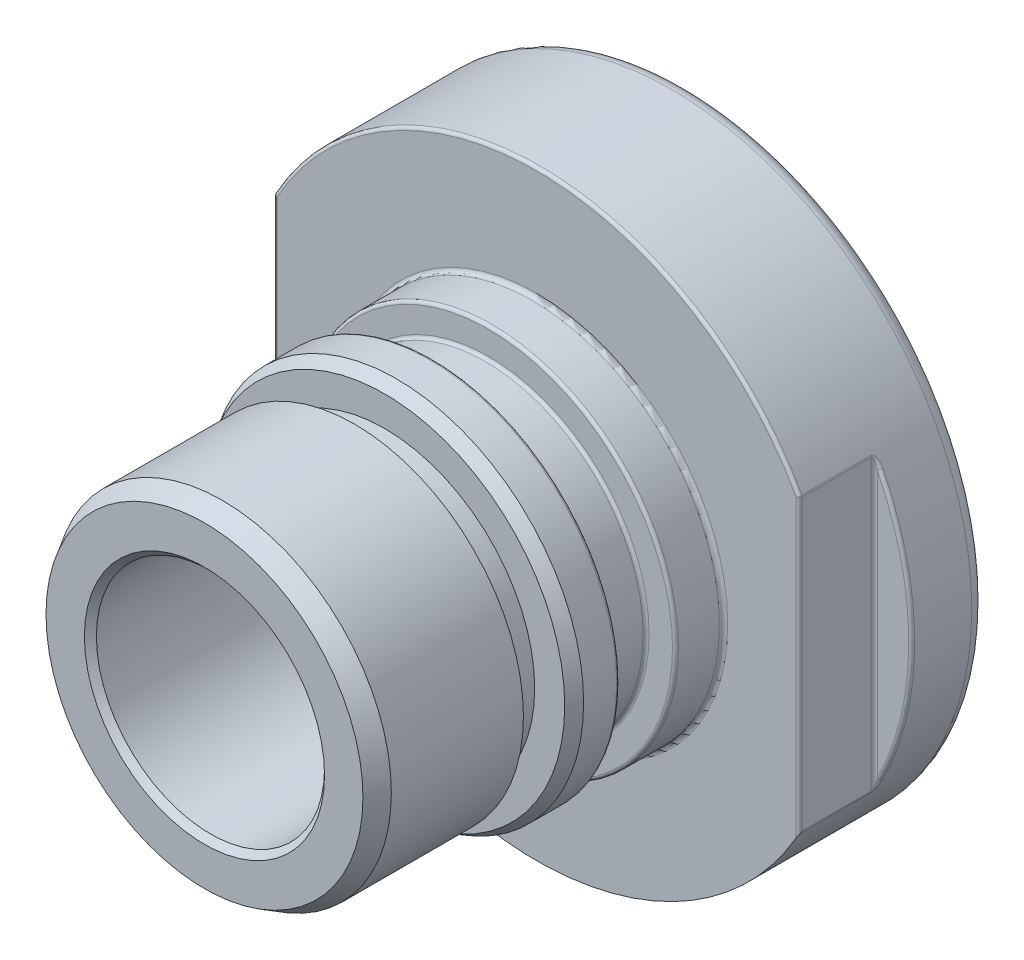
ISO-10303-21;
HEADER;
FILE_DESCRIPTION(('STEP AP214'),'2;1');
FILE_NAME('part.step','',(''),(''),'','','');
FILE_SCHEMA(('AUTOMOTIVE_DESIGN { 1 0 10303 214 1 1 1 1 }'));
ENDSEC;
DATA;
#1=APPLICATION_CONTEXT('core data for automotive mechanical design processes');
#2=APPLICATION_PROTOCOL_DEFINITION('international standard','automotive_design',2000,#1);
#3=PRODUCT_CONTEXT('',#1,'mechanical');
#4=PRODUCT('Part','Part','',(#3));
#5=PRODUCT_RELATED_PRODUCT_CATEGORY('part','',(#4));
#6=PRODUCT_DEFINITION_FORMATION('','',#4);
#7=PRODUCT_DEFINITION_CONTEXT('part definition',#1,'design');
#8=PRODUCT_DEFINITION('design','',#6,#7);
#9=PRODUCT_DEFINITION_SHAPE('','',#8);
#10=(LENGTH_UNIT() NAMED_UNIT(*) SI_UNIT(.MILLI.,.METRE.));
#11=(NAMED_UNIT(*) PLANE_ANGLE_UNIT() SI_UNIT($,.RADIAN.));
#12=(NAMED_UNIT(*) SI_UNIT($,.STERADIAN.) SOLID_ANGLE_UNIT());
#13=UNCERTAINTY_MEASURE_WITH_UNIT(LENGTH_MEASURE(1.E-05),#10,'distance_accuracy_value','');
#14=(GEOMETRIC_REPRESENTATION_CONTEXT(3) GLOBAL_UNCERTAINTY_ASSIGNED_CONTEXT((#13)) GLOBAL_UNIT_ASSIGNED_CONTEXT((#10,
#11,#12)) REPRESENTATION_CONTEXT('',''));
#15=CARTESIAN_POINT('',(0.,0.,0.));
#16=DIRECTION('',(0.,0.,1.));
#17=DIRECTION('',(1.,0.,0.));
#18=AXIS2_PLACEMENT_3D('',#15,#16,#17);
#19=CARTESIAN_POINT('',(0.,0.,0.));
#20=DIRECTION('',(0.,0.,1.));
#21=DIRECTION('',(1.,0.,0.));
#22=AXIS2_PLACEMENT_3D('',#19,#20,#21);
#23=PLANE('',#22);
#24=CARTESIAN_POINT('',(0.,0.,0.));
#25=DIRECTION('',(0.,0.,1.));
#26=DIRECTION('',(1.,0.,0.));
#27=AXIS2_PLACEMENT_3D('',#24,#25,#26);
#28=CIRCLE('',#27,11.7821903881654);
#29=CARTESIAN_POINT('',(11.7821903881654,0.,0.));
#30=VERTEX_POINT('',#29);
#31=EDGE_CURVE('E47',#30,#30,#28,.T.);
#32=ORIENTED_EDGE('',*,*,#31,.T.);
#33=EDGE_LOOP('',(#32));
#34=FACE_BOUND('',#33,.T.);
#35=CARTESIAN_POINT('',(0.,0.,0.));
#36=DIRECTION('',(0.,0.,1.));
#37=DIRECTION('',(1.,0.,0.));
#38=AXIS2_PLACEMENT_3D('',#35,#36,#37);
#39=CIRCLE('',#38,12.065);
#40=CARTESIAN_POINT('',(12.065,0.,0.));
#41=VERTEX_POINT('',#40);
#42=EDGE_CURVE('E745',#41,#41,#39,.F.);
#43=ORIENTED_EDGE('',*,*,#42,.T.);
#44=EDGE_LOOP('',(#43));
#45=FACE_BOUND('',#44,.T.);
#46=ADVANCED_FACE('F38',(#34,#45),#23,.F.);
#47=CARTESIAN_POINT('',(0.,0.,12.7762));
#48=DIRECTION('',(0.,0.,1.));
#49=DIRECTION('',(1.,0.,0.));
#50=AXIS2_PLACEMENT_3D('',#47,#48,#49);
#51=PLANE('',#50);
#52=CARTESIAN_POINT('',(0.,0.,12.7762));
#53=DIRECTION('',(0.,0.,1.));
#54=DIRECTION('',(1.,0.,0.));
#55=AXIS2_PLACEMENT_3D('',#52,#53,#54);
#56=CIRCLE('',#55,7.61880606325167);
#57=CARTESIAN_POINT('',(7.61880606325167,0.,12.7762));
#58=VERTEX_POINT('',#57);
#59=EDGE_CURVE('E1331',#58,#58,#56,.T.);
#60=ORIENTED_EDGE('',*,*,#59,.T.);
#61=EDGE_LOOP('',(#60));
#62=FACE_BOUND('',#61,.T.);
#63=CARTESIAN_POINT('',(0.,0.,12.7762));
#64=DIRECTION('',(0.,0.,1.));
#65=DIRECTION('',(1.,0.,0.));
#66=AXIS2_PLACEMENT_3D('',#63,#64,#65);
#67=CIRCLE('',#66,6.35);
#68=CARTESIAN_POINT('',(6.35,0.,12.7762));
#69=VERTEX_POINT('',#68);
#70=EDGE_CURVE('E614',#69,#69,#67,.T.);
#71=ORIENTED_EDGE('',*,*,#70,.F.);
#72=EDGE_LOOP('',(#71));
#73=FACE_BOUND('',#72,.T.);
#74=ADVANCED_FACE('F350',(#62,#73),#51,.T.);
#75=CARTESIAN_POINT('',(0.,0.,8.382));
#76=DIRECTION('',(0.,0.,1.));
#77=DIRECTION('',(1.,0.,0.));
#78=AXIS2_PLACEMENT_3D('',#75,#76,#77);
#79=PLANE('',#78);
#80=CARTESIAN_POINT('',(0.,0.,8.382));
#81=DIRECTION('',(0.,0.,1.));
#82=DIRECTION('',(1.,0.,0.));
#83=AXIS2_PLACEMENT_3D('',#80,#81,#82);
#84=CIRCLE('',#83,6.7945);
#85=CARTESIAN_POINT('',(6.7945,0.,8.382));
#86=VERTEX_POINT('',#85);
#87=EDGE_CURVE('E272',#86,#86,#84,.F.);
#88=ORIENTED_EDGE('',*,*,#87,.T.);
#89=EDGE_LOOP('',(#88));
#90=FACE_BOUND('',#89,.T.);
#91=CARTESIAN_POINT('',(0.,0.,8.382));
#92=DIRECTION('',(0.,0.,1.));
#93=DIRECTION('',(1.,0.,0.));
#94=AXIS2_PLACEMENT_3D('',#91,#92,#93);
#95=CIRCLE('',#94,7.7851);
#96=CARTESIAN_POINT('',(7.7851,0.,8.382));
#97=VERTEX_POINT('',#96);
#98=EDGE_CURVE('E269',#97,#97,#95,.T.);
#99=ORIENTED_EDGE('',*,*,#98,.T.);
#100=EDGE_LOOP('',(#99));
#101=FACE_BOUND('',#100,.T.);
#102=ADVANCED_FACE('F355',(#90,#101),#79,.T.);
#103=CARTESIAN_POINT('',(0.,0.,6.35));
#104=DIRECTION('',(0.,0.,1.));
#105=DIRECTION('',(1.,0.,0.));
#106=AXIS2_PLACEMENT_3D('',#103,#104,#105);
#107=PLANE('',#106);
#108=CARTESIAN_POINT('',(0.,0.,6.35));
#109=DIRECTION('',(0.,0.,1.));
#110=DIRECTION('',(1.,0.,0.));
#111=AXIS2_PLACEMENT_3D('',#108,#109,#110);
#112=CIRCLE('',#111,8.0899);
#113=CARTESIAN_POINT('',(8.0899,0.,6.35));
#114=VERTEX_POINT('',#113);
#115=EDGE_CURVE('E744',#114,#114,#112,.F.);
#116=ORIENTED_EDGE('',*,*,#115,.T.);
#117=EDGE_LOOP('',(#116));
#118=FACE_BOUND('',#117,.T.);
#119=DIRECTION('',(0.,-1.,0.));
#120=VECTOR('',#119,1.);
#121=CARTESIAN_POINT('',(10.9855,6.14836106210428,6.35));
#122=LINE('',#121,#120);
#123=CARTESIAN_POINT('',(10.9855,-6.37250262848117,6.35));
#124=VERTEX_POINT('',#123);
#125=CARTESIAN_POINT('',(10.9855,6.11548189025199,6.35));
#126=VERTEX_POINT('',#125);
#127=EDGE_CURVE('E150',#124,#126,#122,.F.);
#128=ORIENTED_EDGE('',*,*,#127,.T.);
#129=CARTESIAN_POINT('',(0.,0.,6.35));
#130=DIRECTION('',(0.,0.,1.));
#131=DIRECTION('',(1.,0.,0.));
#132=AXIS2_PLACEMENT_3D('',#129,#130,#131);
#133=CIRCLE('',#132,12.573);
#134=CARTESIAN_POINT('',(-10.9855,6.11548189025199,6.35));
#135=VERTEX_POINT('',#134);
#136=EDGE_CURVE('E54',#126,#135,#133,.T.);
#137=ORIENTED_EDGE('',*,*,#136,.T.);
#138=DIRECTION('',(0.,1.,0.));
#139=VECTOR('',#138,1.);
#140=CARTESIAN_POINT('',(-10.9855,-6.14836106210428,6.35));
#141=LINE('',#140,#139);
#142=CARTESIAN_POINT('',(-10.9855,-6.37250262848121,6.35));
#143=VERTEX_POINT('',#142);
#144=EDGE_CURVE('E141',#135,#143,#141,.F.);
#145=ORIENTED_EDGE('',*,*,#144,.T.);
#146=CARTESIAN_POINT('',(0.,0.,6.35));
#147=DIRECTION('',(0.,0.,1.));
#148=DIRECTION('',(1.,0.,0.));
#149=AXIS2_PLACEMENT_3D('',#146,#147,#148);
#150=CIRCLE('',#149,12.7);
#151=EDGE_CURVE('E144',#143,#124,#150,.T.);
#152=ORIENTED_EDGE('',*,*,#151,.T.);
#153=EDGE_LOOP('',(#128,#137,#145,#152));
#154=FACE_BOUND('',#153,.T.);
#155=ADVANCED_FACE('F143',(#118,#154),#107,.T.);
#156=CARTESIAN_POINT('',(0.,0.,6.35));
#157=DIRECTION('',(0.,0.,-1.));
#158=DIRECTION('',(-1.,0.,0.));
#159=AXIS2_PLACEMENT_3D('',#156,#157,#158);
#160=CYLINDRICAL_SURFACE('',#159,12.7);
#161=CARTESIAN_POINT('',(0.,0.,0.635));
#162=DIRECTION('',(0.,0.,1.));
#163=DIRECTION('',(1.,0.,0.));
#164=AXIS2_PLACEMENT_3D('',#161,#162,#163);
#165=CIRCLE('',#164,12.7);
#166=CARTESIAN_POINT('',(12.7,0.,0.635));
#167=VERTEX_POINT('',#166);
#168=EDGE_CURVE('E750',#167,#167,#165,.T.);
#169=ORIENTED_EDGE('',*,*,#168,.T.);
#170=EDGE_LOOP('',(#169));
#171=FACE_BOUND('',#170,.T.);
#172=DIRECTION('',(0.,0.,-1.));
#173=VECTOR('',#172,1.);
#174=CARTESIAN_POINT('',(-11.0964646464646,6.17725443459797,6.35));
#175=LINE('',#174,#173);
#176=CARTESIAN_POINT('',(-11.0964646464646,6.17725443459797,3.302));
#177=VERTEX_POINT('',#176);
#178=CARTESIAN_POINT('',(-11.0964646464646,6.17725443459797,6.223));
#179=VERTEX_POINT('',#178);
#180=EDGE_CURVE('E169',#177,#179,#175,.F.);
#181=ORIENTED_EDGE('',*,*,#180,.T.);
#182=CARTESIAN_POINT('',(0.,0.,6.223));
#183=DIRECTION('',(0.,0.,1.));
#184=DIRECTION('',(1.,0.,0.));
#185=AXIS2_PLACEMENT_3D('',#182,#183,#184);
#186=CIRCLE('',#185,12.7);
#187=CARTESIAN_POINT('',(11.0964646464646,6.17725443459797,6.223));
#188=VERTEX_POINT('',#187);
#189=EDGE_CURVE('E305',#179,#188,#186,.F.);
#190=ORIENTED_EDGE('',*,*,#189,.T.);
#191=DIRECTION('',(0.,0.,-1.));
#192=VECTOR('',#191,1.);
#193=CARTESIAN_POINT('',(11.0964646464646,6.17725443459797,6.35));
#194=LINE('',#193,#192);
#195=CARTESIAN_POINT('',(11.0964646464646,6.17725443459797,3.302));
#196=VERTEX_POINT('',#195);
#197=EDGE_CURVE('E563',#188,#196,#194,.T.);
#198=ORIENTED_EDGE('',*,*,#197,.T.);
#199=CARTESIAN_POINT('',(11.1221955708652,6.08051806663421,3.35066899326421));
#200=CARTESIAN_POINT('',(11.1312224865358,6.11448035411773,3.3724261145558));
#201=CARTESIAN_POINT('',(11.1160516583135,6.14193744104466,3.39933798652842));
#202=CARTESIAN_POINT('',(11.1207569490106,6.08572578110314,3.34720328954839));
#203=CARTESIAN_POINT('',(11.128455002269,6.11952007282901,3.36757404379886));
#204=CARTESIAN_POINT('',(11.1131453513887,6.14719775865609,3.39240657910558));
#205=CARTESIAN_POINT('',(11.1194147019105,6.0905752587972,3.34353149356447));
#206=CARTESIAN_POINT('',(11.1258612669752,6.12423454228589,3.36235689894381));
#207=CARTESIAN_POINT('',(11.1104337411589,6.15209622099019,3.38506298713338));
#208=CARTESIAN_POINT('',(11.1170017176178,6.09928253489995,3.33576265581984));
#209=CARTESIAN_POINT('',(11.1212021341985,6.13269310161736,3.35123122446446));
#210=CARTESIAN_POINT('',(11.1055590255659,6.16089144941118,3.3695253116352));
#211=CARTESIAN_POINT('',(11.1159345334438,6.10312736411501,3.33166092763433));
#212=CARTESIAN_POINT('',(11.1191384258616,6.13643403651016,3.34531130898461));
#213=CARTESIAN_POINT('',(11.1034030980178,6.16477511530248,3.36132185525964));
#214=CARTESIAN_POINT('',(11.1142427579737,6.10921748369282,3.32336205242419));
#215=CARTESIAN_POINT('',(11.1158701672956,6.14235378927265,3.33326719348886));
#216=CARTESIAN_POINT('',(11.0999853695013,6.17092675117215,3.34472410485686));
#217=CARTESIAN_POINT('',(11.1135955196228,6.11154466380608,3.31918527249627));
#218=CARTESIAN_POINT('',(11.1146177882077,6.14461959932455,3.32717139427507));
#219=CARTESIAN_POINT('',(11.0986778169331,6.1732774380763,3.3363705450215));
#220=CARTESIAN_POINT('',(11.1127242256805,6.11467648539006,3.31067372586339));
#221=CARTESIAN_POINT('',(11.1129339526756,6.14766509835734,3.31472284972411));
#222=CARTESIAN_POINT('',(11.0969176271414,6.17644089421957,3.31934745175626));
#223=CARTESIAN_POINT('',(11.1124975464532,6.11549056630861,3.30634011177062));
#224=CARTESIAN_POINT('',(11.1124948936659,6.14845854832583,3.30836316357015));
#225=CARTESIAN_POINT('',(11.0964596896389,6.17726319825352,3.31068022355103));
#226=CARTESIAN_POINT('',(11.1125042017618,6.11546703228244,3.29456744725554));
#227=CARTESIAN_POINT('',(11.1125087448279,6.1484338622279,3.2911027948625));
#228=CARTESIAN_POINT('',(11.096473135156,6.17723942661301,3.28713489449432));
#229=CARTESIAN_POINT('',(11.1131803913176,6.11303923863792,3.2871158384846));
#230=CARTESIAN_POINT('',(11.1138212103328,6.14606261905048,3.28015379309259));
#231=CARTESIAN_POINT('',(11.0978391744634,6.17478710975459,3.27223167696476));
#232=CARTESIAN_POINT('',(11.1158986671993,6.10325822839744,3.27151050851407));
#233=CARTESIAN_POINT('',(11.1190735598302,6.1365531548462,3.25743655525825));
#234=CARTESIAN_POINT('',(11.1033306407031,6.16490730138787,3.2410210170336));
#235=CARTESIAN_POINT('',(11.1182151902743,6.09491485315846,3.26357941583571));
#236=CARTESIAN_POINT('',(11.1235696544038,6.12840531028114,3.24600089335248));
#237=CARTESIAN_POINT('',(11.1080104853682,6.15647964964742,3.22515883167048));
#238=CARTESIAN_POINT('',(11.1252101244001,6.06961791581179,3.24534169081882));
#239=CARTESIAN_POINT('',(11.1371031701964,6.10378300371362,3.22013829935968));
#240=CARTESIAN_POINT('',(11.122141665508,6.13092718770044,3.18868338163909));
#241=CARTESIAN_POINT('',(11.1304870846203,6.05045183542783,3.23611869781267));
#242=CARTESIAN_POINT('',(11.1473289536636,6.08509939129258,3.2076045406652));
#243=CARTESIAN_POINT('',(11.132802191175,6.11156751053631,3.17023739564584));
#244=CARTESIAN_POINT('',(11.1413546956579,6.0106863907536,3.22090473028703));
#245=CARTESIAN_POINT('',(11.1682335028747,6.04663680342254,3.18789908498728));
#246=CARTESIAN_POINT('',(11.1547569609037,6.07140039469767,3.13980946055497));
#247=CARTESIAN_POINT('',(11.1468987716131,5.99027641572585,3.21473502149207));
#248=CARTESIAN_POINT('',(11.1789047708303,6.02688405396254,3.18045970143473));
#249=CARTESIAN_POINT('',(11.1659571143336,6.05078425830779,3.12747004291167));
#250=CARTESIAN_POINT('',(11.158310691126,5.94796517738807,3.20402770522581));
#251=CARTESIAN_POINT('',(11.2007781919,5.9861272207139,3.16853605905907));
#252=CARTESIAN_POINT('',(11.1890114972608,6.00804563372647,3.10605541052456));
#253=CARTESIAN_POINT('',(11.1641803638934,5.92605528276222,3.19950068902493));
#254=CARTESIAN_POINT('',(11.2120188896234,5.9650430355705,3.16413328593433));
#255=CARTESIAN_POINT('',(11.2008694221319,5.98591442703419,3.09700137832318));
#256=CARTESIAN_POINT('',(11.1760668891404,5.88135585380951,3.19174669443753));
#257=CARTESIAN_POINT('',(11.234683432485,5.92223942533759,3.15780265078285));
#258=CARTESIAN_POINT('',(11.2248826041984,5.94076348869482,3.08149338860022));
#259=CARTESIAN_POINT('',(11.1820843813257,5.8585620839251,3.18852713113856));
#260=CARTESIAN_POINT('',(11.2461312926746,5.9004647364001,3.15595459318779));
#261=CARTESIAN_POINT('',(11.2370391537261,5.91773947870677,3.07505426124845));
#262=CARTESIAN_POINT('',(11.194158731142,5.81247589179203,3.18318636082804));
#263=CARTESIAN_POINT('',(11.2689866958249,5.85669018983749,3.15445689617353));
#264=CARTESIAN_POINT('',(11.2614317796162,5.87118776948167,3.06437272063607));
#265=CARTESIAN_POINT('',(11.2002156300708,5.78918285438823,3.1810666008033));
#266=CARTESIAN_POINT('',(11.2804129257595,5.83464453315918,3.15487870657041));
#267=CARTESIAN_POINT('',(11.2736679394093,5.84765944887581,3.06013320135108));
#268=CARTESIAN_POINT('',(11.2121319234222,5.74299936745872,3.17783448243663));
#269=CARTESIAN_POINT('',(11.3027392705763,5.79126825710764,3.15772338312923));
#270=CARTESIAN_POINT('',(11.2977412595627,5.80100946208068,3.0536689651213));
#271=CARTESIAN_POINT('',(11.2179919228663,5.7201170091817,3.1766945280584));
#272=CARTESIAN_POINT('',(11.3136698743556,5.76987716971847,3.16015843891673));
#273=CARTESIAN_POINT('',(11.3095796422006,5.77789596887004,3.05138905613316));
#274=CARTESIAN_POINT('',(11.2296443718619,5.67426929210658,3.17524928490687));
#275=CARTESIAN_POINT('',(11.3352269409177,5.72741103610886,3.1669156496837));
#276=CARTESIAN_POINT('',(11.3331199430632,5.73158514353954,3.04849856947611));
#277=CARTESIAN_POINT('',(11.2354369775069,5.65130443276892,3.17494133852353));
#278=CARTESIAN_POINT('',(11.3458671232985,5.70629913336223,3.17131093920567));
#279=CARTESIAN_POINT('',(11.344822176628,5.70838831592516,3.04788267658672));
#280=CARTESIAN_POINT('',(11.241190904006,5.6283157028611,3.17501125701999));
#281=CARTESIAN_POINT('',(11.3561033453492,5.68585238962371,3.17654136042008));
#282=CARTESIAN_POINT('',(11.3564462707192,5.68516737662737,3.04802251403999));
#283=(BOUNDED_SURFACE() B_SPLINE_SURFACE(3,2,((#199,#200,#201),(#202,#203,#204),(#205,#206,
#207),(#208,#209,#210),(#211,#212,#213),(#214,#215,#216),(#217,#218,#219),(#220,#221,#222),
(#223,#224,#225),(#226,#227,#228),(#229,#230,#231),(#232,#233,#234),(#235,#236,#237),(#238,#239,
#240),(#241,#242,#243),(#244,#245,#246),(#247,#248,#249),(#250,#251,#252),(#253,#254,#255),
(#256,#257,#258),(#259,#260,#261),(#262,#263,#264),(#265,#266,#267),(#268,#269,#270),(#271,#272,
#273),(#274,#275,#276),(#277,#278,#279),(#280,#281,#282)),.UNSPECIFIED.,.F.,.F.,
.F.) B_SPLINE_SURFACE_WITH_KNOTS((4,2,2,2,2,2,2,2,2,2,2,2,2,4),(3,3),(0.,0.0274608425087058,
0.0552603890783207,0.0813978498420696,0.107371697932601,0.151852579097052,0.20639793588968,
0.29086604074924,0.369521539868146,0.44867551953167,0.528272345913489,0.607973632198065,
0.685348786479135,0.762476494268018),(0.,1.),
.UNSPECIFIED.) GEOMETRIC_REPRESENTATION_ITEM() RATIONAL_B_SPLINE_SURFACE(((1.,0.9509095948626,
1.),(1.,0.953461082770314,1.),(1.,0.955828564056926,1.),(1.,0.960069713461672,1.),(1.,
0.961936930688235,1.),(1.,0.964890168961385,1.),(1.,0.966016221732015,1.),(1.,0.967530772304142,
1.),(1.,0.967923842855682,1.),(1.,0.967912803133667,1.),(1.,0.966741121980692,1.),(1.,
0.962001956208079,1.),(1.,0.957952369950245,1.),(1.,0.945580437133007,1.),(1.,0.936132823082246,
1.),(1.,0.916240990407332,1.),(1.,0.905910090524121,1.),(1.,0.884167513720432,1.),(1.,
0.872749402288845,1.),(1.,0.849054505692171,1.),(1.,0.836773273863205,1.),(1.,0.811462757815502,
1.),(1.,0.798432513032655,1.),(1.,0.77203791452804,1.),(1.,0.758694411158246,1.),(1.,
0.731322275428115,1.),(1.,0.717295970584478,1.),(1.,0.702884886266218,1.))) REPRESENTATION_ITEM('') SURFACE());
#284=CARTESIAN_POINT('',(11.3564462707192,5.68516737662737,3.04802251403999));
#285=CARTESIAN_POINT('',(11.344822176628,5.70838831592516,3.04788267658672));
#286=CARTESIAN_POINT('',(11.3331199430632,5.73158514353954,3.04849856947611));
#287=CARTESIAN_POINT('',(11.3095796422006,5.77789596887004,3.05138905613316));
#288=CARTESIAN_POINT('',(11.2977412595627,5.80100946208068,3.0536689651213));
#289=CARTESIAN_POINT('',(11.2736679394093,5.84765944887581,3.06013320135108));
#290=CARTESIAN_POINT('',(11.2614317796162,5.87118776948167,3.06437272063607));
#291=CARTESIAN_POINT('',(11.2370391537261,5.91773947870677,3.07505426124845));
#292=CARTESIAN_POINT('',(11.2248826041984,5.94076348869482,3.08149338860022));
#293=CARTESIAN_POINT('',(11.2008694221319,5.98591442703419,3.09700137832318));
#294=CARTESIAN_POINT('',(11.1890114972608,6.00804563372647,3.10605541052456));
#295=CARTESIAN_POINT('',(11.1659571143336,6.05078425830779,3.12747004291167));
#296=CARTESIAN_POINT('',(11.1547569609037,6.07140039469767,3.13980946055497));
#297=CARTESIAN_POINT('',(11.132802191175,6.11156751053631,3.17023739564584));
#298=CARTESIAN_POINT('',(11.122141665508,6.13092718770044,3.18868338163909));
#299=CARTESIAN_POINT('',(11.1080104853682,6.15647964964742,3.22515883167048));
#300=CARTESIAN_POINT('',(11.1033306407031,6.16490730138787,3.2410210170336));
#301=CARTESIAN_POINT('',(11.0978391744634,6.17478710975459,3.27223167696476));
#302=CARTESIAN_POINT('',(11.096473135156,6.17723942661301,3.28713489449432));
#303=CARTESIAN_POINT('',(11.0964596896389,6.17726319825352,3.31068022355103));
#304=CARTESIAN_POINT('',(11.0969176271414,6.17644089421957,3.31934745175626));
#305=CARTESIAN_POINT('',(11.0986778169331,6.1732774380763,3.3363705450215));
#306=CARTESIAN_POINT('',(11.0999853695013,6.17092675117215,3.34472410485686));
#307=CARTESIAN_POINT('',(11.1034030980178,6.16477511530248,3.36132185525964));
#308=CARTESIAN_POINT('',(11.1055590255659,6.16089144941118,3.3695253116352));
#309=CARTESIAN_POINT('',(11.1104337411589,6.15209622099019,3.38506298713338));
#310=CARTESIAN_POINT('',(11.1131453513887,6.14719775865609,3.39240657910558));
#311=CARTESIAN_POINT('',(11.1160516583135,6.14193744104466,3.39933798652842));
#312=B_SPLINE_CURVE_WITH_KNOTS('',3,(#284,#285,#286,#287,#288,#289,#290,#291,#292,#293,#294,
#295,#296,#297,#298,#299,#300,#301,#302,#303,#304,#305,#306,#307,#308,#309,#310,#311),
.UNSPECIFIED.,.F.,.F.,(4,2,2,2,2,2,2,2,2,2,2,2,2,4),(0.,0.0771277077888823,0.154502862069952,
0.234204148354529,0.313800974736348,0.392954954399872,0.471610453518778,0.556078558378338,
0.610623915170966,0.655104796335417,0.681078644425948,0.707216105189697,0.735015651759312,
0.762476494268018),.UNSPECIFIED.);
#313=CARTESIAN_POINT('',(11.3530303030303,5.6919858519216,3.048));
#314=VERTEX_POINT('',#313);
#315=EDGE_CURVE('E238',#196,#314,#312,.F.);
#316=ORIENTED_EDGE('',*,*,#315,.T.);
#317=CARTESIAN_POINT('',(0.,0.,3.048));
#318=DIRECTION('',(0.,0.,1.));
#319=DIRECTION('',(1.,0.,0.));
#320=AXIS2_PLACEMENT_3D('',#317,#318,#319);
#321=CIRCLE('',#320,12.7);
#322=CARTESIAN_POINT('',(11.3530303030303,-5.6919858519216,3.048));
#323=VERTEX_POINT('',#322);
#324=EDGE_CURVE('E171',#314,#323,#321,.F.);
#325=ORIENTED_EDGE('',*,*,#324,.T.);
#326=CARTESIAN_POINT('',(11.257997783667,-5.56066333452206,3.17635433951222));
#327=CARTESIAN_POINT('',(11.3862376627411,-5.62527158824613,3.19523404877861));
#328=CARTESIAN_POINT('',(11.3903995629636,-5.61683165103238,3.05070867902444));
#329=CARTESIAN_POINT('',(11.2549469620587,-5.57303653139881,3.1759045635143));
#330=CARTESIAN_POINT('',(11.380910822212,-5.63605026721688,3.19130641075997));
#331=CARTESIAN_POINT('',(11.3842362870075,-5.62932982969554,3.04980912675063));
#332=CARTESIAN_POINT('',(11.2518844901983,-5.58540617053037,3.17556723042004));
#333=CARTESIAN_POINT('',(11.3754494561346,-5.64706444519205,3.18763863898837));
#334=CARTESIAN_POINT('',(11.3780494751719,-5.64182441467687,3.04913446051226));
#335=CARTESIAN_POINT('',(11.2457188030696,-5.61020712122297,3.17511495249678));
#336=CARTESIAN_POINT('',(11.3643761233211,-5.66931358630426,3.18090101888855));
#337=CARTESIAN_POINT('',(11.3655935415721,-5.66687588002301,3.04822990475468));
#338=CARTESIAN_POINT('',(11.2426154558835,-5.62263839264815,3.17500125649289));
#339=CARTESIAN_POINT('',(11.3587616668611,-5.6805549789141,3.17781762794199));
#340=CARTESIAN_POINT('',(11.3593241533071,-5.67943271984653,3.04800251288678));
#341=CARTESIAN_POINT('',(11.225785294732,-5.68977416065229,3.17499446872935));
#342=CARTESIAN_POINT('',(11.3292256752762,-5.73946280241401,3.1632972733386));
#343=CARTESIAN_POINT('',(11.3253238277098,-5.74724662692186,3.04798893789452));
#344=CARTESIAN_POINT('',(11.2118359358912,-5.74441119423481,3.17716789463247));
#345=CARTESIAN_POINT('',(11.3031070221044,-5.79079789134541,3.15605860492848));
#346=CARTESIAN_POINT('',(11.2971433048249,-5.8024355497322,3.05233578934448));
#347=CARTESIAN_POINT('',(11.1909499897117,-5.8247893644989,3.18441956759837));
#348=CARTESIAN_POINT('',(11.2629969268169,-5.86821768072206,3.15447810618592));
#349=CARTESIAN_POINT('',(11.2549494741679,-5.88362562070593,3.06683913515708));
#350=CARTESIAN_POINT('',(11.1840036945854,-5.85128453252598,3.18749522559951));
#351=CARTESIAN_POINT('',(11.2498237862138,-5.89344034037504,3.15533326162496));
#352=CARTESIAN_POINT('',(11.2409165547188,-5.9103884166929,3.07299045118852));
#353=CARTESIAN_POINT('',(11.1702006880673,-5.903489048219,3.19527626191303));
#354=CARTESIAN_POINT('',(11.2235716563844,-5.9432884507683,3.16036412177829));
#355=CARTESIAN_POINT('',(11.2130316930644,-5.96312025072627,3.08855252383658));
#356=CARTESIAN_POINT('',(11.1633440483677,-5.92919778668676,3.19998287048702));
#357=CARTESIAN_POINT('',(11.2104590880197,-5.96799078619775,3.16444154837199));
#358=CARTESIAN_POINT('',(11.1991798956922,-5.98908867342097,3.09796574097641));
#359=CARTESIAN_POINT('',(11.1518804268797,-5.97183957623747,3.20985188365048));
#360=CARTESIAN_POINT('',(11.1884202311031,-6.0091839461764,3.17491696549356));
#361=CARTESIAN_POINT('',(11.1760210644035,-6.03216118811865,3.11770376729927));
#362=CARTESIAN_POINT('',(11.1471949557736,-5.98916517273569,3.2144913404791));
#363=CARTESIAN_POINT('',(11.179420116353,-6.02591305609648,3.18023259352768));
#364=CARTESIAN_POINT('',(11.1665554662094,-6.04966179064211,3.12698268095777));
#365=CARTESIAN_POINT('',(11.138163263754,-6.02238680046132,3.22513450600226));
#366=CARTESIAN_POINT('',(11.162065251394,-6.05800595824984,3.1933398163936));
#367=CARTESIAN_POINT('',(11.1483096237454,-6.08321899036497,3.14826901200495));
#368=CARTESIAN_POINT('',(11.1338155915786,-6.03828899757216,3.23113188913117));
#369=CARTESIAN_POINT('',(11.1536815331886,-6.07342717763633,3.20108676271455));
#370=CARTESIAN_POINT('',(11.1395264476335,-6.09928181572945,3.16026377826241));
#371=CARTESIAN_POINT('',(11.1260302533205,-6.06663675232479,3.24446416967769));
#372=CARTESIAN_POINT('',(11.1386726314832,-6.10091284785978,3.21908227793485));
#373=CARTESIAN_POINT('',(11.1237984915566,-6.12791591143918,3.18692833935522));
#374=CARTESIAN_POINT('',(11.1225517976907,-6.07923983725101,3.25168674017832));
#375=CARTESIAN_POINT('',(11.1319402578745,-6.11318394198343,3.22910960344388));
#376=CARTESIAN_POINT('',(11.1167713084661,-6.14064630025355,3.2013734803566));
#377=CARTESIAN_POINT('',(11.1167547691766,-6.10018289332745,3.26827157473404));
#378=CARTESIAN_POINT('',(11.1207521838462,-6.13351857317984,3.25271596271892));
#379=CARTESIAN_POINT('',(11.1050601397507,-6.16180090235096,3.23454314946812));
#380=CARTESIAN_POINT('',(11.114448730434,-6.10847681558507,3.27765546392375));
#381=CARTESIAN_POINT('',(11.1162691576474,-6.14163179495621,3.26635033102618));
#382=CARTESIAN_POINT('',(11.1004014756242,-6.17017860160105,3.25331092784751));
#383=CARTESIAN_POINT('',(11.112533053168,-6.11536427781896,3.29451841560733));
#384=CARTESIAN_POINT('',(11.1125668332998,-6.14832973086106,3.29100065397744));
#385=CARTESIAN_POINT('',(11.0965314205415,-6.17713563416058,3.28703683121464));
#386=CARTESIAN_POINT('',(11.1123072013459,-6.11617487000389,3.3016801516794));
#387=CARTESIAN_POINT('',(11.112128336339,-6.14912165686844,3.30154390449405));
#388=CARTESIAN_POINT('',(11.0960751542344,-6.1779544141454,3.30136030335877));
#389=CARTESIAN_POINT('',(11.1130461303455,-6.11351941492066,3.3157126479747));
#390=CARTESIAN_POINT('',(11.1135554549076,-6.14654099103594,3.3221031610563));
#391=CARTESIAN_POINT('',(11.0975679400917,-6.17527213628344,3.32942529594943));
#392=CARTESIAN_POINT('',(11.1140096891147,-6.11005775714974,3.32258369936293));
#393=CARTESIAN_POINT('',(11.1154248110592,-6.14316163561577,3.33216294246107));
#394=CARTESIAN_POINT('',(11.0995145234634,-6.17177551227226,3.34316739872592));
#395=CARTESIAN_POINT('',(11.1163924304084,-6.10147786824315,3.33355427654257));
#396=CARTESIAN_POINT('',(11.1200234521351,-6.13482993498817,3.34805091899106));
#397=CARTESIAN_POINT('',(11.1043281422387,-6.16310895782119,3.36510855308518));
#398=CARTESIAN_POINT('',(11.1175943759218,-6.09714587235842,3.33787472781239));
#399=CARTESIAN_POINT('',(11.1223478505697,-6.13061488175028,3.3542716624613));
#400=CARTESIAN_POINT('',(11.1067563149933,-6.15873320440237,3.3737494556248));
#401=CARTESIAN_POINT('',(11.1203021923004,-6.08736920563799,3.34603236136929));
#402=CARTESIAN_POINT('',(11.1275758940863,-6.12111834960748,3.36591473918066));
#403=CARTESIAN_POINT('',(11.1122266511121,-6.14885778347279,3.39006472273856));
#404=CARTESIAN_POINT('',(11.1218051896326,-6.08193504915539,3.3498735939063));
#405=CARTESIAN_POINT('',(11.130480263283,-6.11583561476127,3.3713473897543));
#406=CARTESIAN_POINT('',(11.1152630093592,-6.14336873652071,3.39774718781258));
#407=CARTESIAN_POINT('',(11.1234073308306,-6.07612976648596,3.35349264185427));
#408=CARTESIAN_POINT('',(11.1335601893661,-6.11022165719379,3.37638275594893));
#409=CARTESIAN_POINT('',(11.1184996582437,-6.13750481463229,3.40498528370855));
#410=(BOUNDED_SURFACE() B_SPLINE_SURFACE(3,2,((#326,#327,#328),(#329,#330,#331),(#332,#333,
#334),(#335,#336,#337),(#338,#339,#340),(#341,#342,#343),(#344,#345,#346),(#347,#348,#349),
(#350,#351,#352),(#353,#354,#355),(#356,#357,#358),(#359,#360,#361),(#362,#363,#364),(#365,#366,
#367),(#368,#369,#370),(#371,#372,#373),(#374,#375,#376),(#377,#378,#379),(#380,#381,#382),
(#383,#384,#385),(#386,#387,#388),(#389,#390,#391),(#392,#393,#394),(#395,#396,#397),(#398,#399,
#400),(#401,#402,#403),(#404,#405,#406),(#407,#408,#409)),.UNSPECIFIED.,.F.,.F.,
.F.) B_SPLINE_SURFACE_WITH_KNOTS((4,2,2,2,2,2,2,2,2,2,2,2,2,4),(3,3),(0.,0.0414586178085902,
0.0831480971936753,0.266671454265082,0.358186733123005,0.449771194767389,0.514941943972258,
0.579815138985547,0.640470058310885,0.701760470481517,0.743956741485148,0.786109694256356,
0.815869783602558,0.845358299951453),(0.,1.),
.UNSPECIFIED.) GEOMETRIC_REPRESENTATION_ITEM() RATIONAL_B_SPLINE_SURFACE(((1.,0.659305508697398,
1.),(1.,0.667501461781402,1.),(1.,0.675563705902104,1.),(1.,0.69149030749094,1.),(1.,
0.699353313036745,1.),(1.,0.741238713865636,1.),(1.,0.773247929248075,1.),(1.,0.818319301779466,
1.),(1.,0.832835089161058,1.),(1.,0.860879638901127,1.),(1.,0.874407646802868,1.),(1.,
0.89647250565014,1.),(1.,0.905323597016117,1.),(1.,0.922117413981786,1.),(1.,0.930064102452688,
1.),(1.,0.944108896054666,1.),(1.,0.950293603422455,1.),(1.,0.960516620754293,1.),(1.,
0.964531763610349,1.),(1.,0.967863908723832,1.),(1.,0.968254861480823,1.),(1.,0.966971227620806,
1.),(1.,0.965298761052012,1.),(1.,0.961136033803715,1.),(1.,0.959030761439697,1.),(1.,
0.954263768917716,1.),(1.,0.951607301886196,1.),(1.,0.948757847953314,1.))) REPRESENTATION_ITEM('') SURFACE());
#411=CARTESIAN_POINT('',(11.1184996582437,-6.13750481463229,3.40498528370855));
#412=CARTESIAN_POINT('',(11.1152630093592,-6.14336873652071,3.39774718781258));
#413=CARTESIAN_POINT('',(11.1122266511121,-6.14885778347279,3.39006472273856));
#414=CARTESIAN_POINT('',(11.1067563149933,-6.15873320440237,3.3737494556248));
#415=CARTESIAN_POINT('',(11.1043281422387,-6.16310895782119,3.36510855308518));
#416=CARTESIAN_POINT('',(11.0995145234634,-6.17177551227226,3.34316739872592));
#417=CARTESIAN_POINT('',(11.0975679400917,-6.17527213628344,3.32942529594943));
#418=CARTESIAN_POINT('',(11.0960751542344,-6.1779544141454,3.30136030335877));
#419=CARTESIAN_POINT('',(11.0965314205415,-6.17713563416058,3.28703683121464));
#420=CARTESIAN_POINT('',(11.1004014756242,-6.17017860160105,3.25331092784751));
#421=CARTESIAN_POINT('',(11.1050601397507,-6.16180090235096,3.23454314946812));
#422=CARTESIAN_POINT('',(11.1167713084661,-6.14064630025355,3.2013734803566));
#423=CARTESIAN_POINT('',(11.1237984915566,-6.12791591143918,3.18692833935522));
#424=CARTESIAN_POINT('',(11.1395264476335,-6.09928181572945,3.16026377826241));
#425=CARTESIAN_POINT('',(11.1483096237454,-6.08321899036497,3.14826901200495));
#426=CARTESIAN_POINT('',(11.1665554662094,-6.04966179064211,3.12698268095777));
#427=CARTESIAN_POINT('',(11.1760210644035,-6.03216118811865,3.11770376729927));
#428=CARTESIAN_POINT('',(11.1991798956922,-5.98908867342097,3.09796574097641));
#429=CARTESIAN_POINT('',(11.2130316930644,-5.96312025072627,3.08855252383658));
#430=CARTESIAN_POINT('',(11.2409165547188,-5.9103884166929,3.07299045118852));
#431=CARTESIAN_POINT('',(11.2549494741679,-5.88362562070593,3.06683913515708));
#432=CARTESIAN_POINT('',(11.2971433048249,-5.8024355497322,3.05233578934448));
#433=CARTESIAN_POINT('',(11.3253238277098,-5.74724662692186,3.04798893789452));
#434=CARTESIAN_POINT('',(11.3593241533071,-5.67943271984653,3.04800251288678));
#435=CARTESIAN_POINT('',(11.3655935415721,-5.66687588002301,3.04822990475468));
#436=CARTESIAN_POINT('',(11.3780494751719,-5.64182441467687,3.04913446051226));
#437=CARTESIAN_POINT('',(11.3842362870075,-5.62932982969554,3.04980912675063));
#438=CARTESIAN_POINT('',(11.3903995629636,-5.61683165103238,3.05070867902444));
#439=B_SPLINE_CURVE_WITH_KNOTS('',3,(#411,#412,#413,#414,#415,#416,#417,#418,#419,#420,#421,
#422,#423,#424,#425,#426,#427,#428,#429,#430,#431,#432,#433,#434,#435,#436,#437,#438),
.UNSPECIFIED.,.F.,.F.,(4,2,2,2,2,2,2,2,2,2,2,2,2,4),(0.,0.0294885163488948,0.0592486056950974,
0.101401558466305,0.143597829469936,0.204888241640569,0.265543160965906,0.330416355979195,
0.395587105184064,0.487171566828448,0.578686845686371,0.762210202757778,0.803899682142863,
0.845358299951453),.UNSPECIFIED.);
#440=CARTESIAN_POINT('',(11.0964646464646,-6.17725443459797,3.302));
#441=VERTEX_POINT('',#440);
#442=EDGE_CURVE('E247',#323,#441,#439,.F.);
#443=ORIENTED_EDGE('',*,*,#442,.T.);
#444=DIRECTION('',(0.,0.,-1.));
#445=VECTOR('',#444,1.);
#446=CARTESIAN_POINT('',(11.0964646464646,-6.17725443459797,6.35));
#447=LINE('',#446,#445);
#448=CARTESIAN_POINT('',(11.0964646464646,-6.17725443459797,6.28477254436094));
#449=VERTEX_POINT('',#448);
#450=EDGE_CURVE('E569',#441,#449,#447,.F.);
#451=ORIENTED_EDGE('',*,*,#450,.T.);
#452=CARTESIAN_POINT('',(11.0964646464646,-6.17725443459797,6.28477254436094));
#453=CARTESIAN_POINT('',(11.0924583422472,-6.18445220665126,6.29188261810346));
#454=CARTESIAN_POINT('',(11.0881377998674,-6.19219590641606,6.29812154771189));
#455=CARTESIAN_POINT('',(11.079099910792,-6.20835135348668,6.30914445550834));
#456=CARTESIAN_POINT('',(11.0743861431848,-6.21675704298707,6.31394004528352));
#457=CARTESIAN_POINT('',(11.0604785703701,-6.24148681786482,6.32621416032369));
#458=CARTESIAN_POINT('',(11.0509843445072,-6.25828473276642,6.33235254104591));
#459=CARTESIAN_POINT('',(11.0315317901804,-6.2925113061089,6.34185820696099));
#460=CARTESIAN_POINT('',(11.0215705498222,-6.30994370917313,6.34520467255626));
#461=CARTESIAN_POINT('',(11.0071859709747,-6.33497692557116,6.34821201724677));
#462=CARTESIAN_POINT('',(11.0028440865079,-6.34251510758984,6.34888637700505));
#463=CARTESIAN_POINT('',(10.9941708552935,-6.35753739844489,6.34977787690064));
#464=CARTESIAN_POINT('',(10.9898397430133,-6.36502141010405,6.34999892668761));
#465=CARTESIAN_POINT('',(10.9855,-6.37250262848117,6.35));
#466=B_SPLINE_CURVE_WITH_KNOTS('',3,(#452,#453,#454,#455,#456,#457,#458,#459,#460,#461,#462,
#463,#464,#465),.UNSPECIFIED.,.F.,.F.,(4,2,2,2,2,2,4),(0.,0.0324577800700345,0.0646469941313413,
0.125092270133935,0.185984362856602,0.212150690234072,0.238090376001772),.UNSPECIFIED.);
#467=EDGE_CURVE('E157',#449,#124,#466,.T.);
#468=ORIENTED_EDGE('',*,*,#467,.T.);
#469=ORIENTED_EDGE('',*,*,#151,.F.);
#470=CARTESIAN_POINT('',(-10.9855,-6.37250262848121,6.35));
#471=CARTESIAN_POINT('',(-10.9921948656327,-6.36096182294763,6.34998960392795));
#472=CARTESIAN_POINT('',(-10.9988734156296,-6.34940642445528,6.34946980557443));
#473=CARTESIAN_POINT('',(-11.0121730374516,-6.32631186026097,6.34735341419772));
#474=CARTESIAN_POINT('',(-11.0187938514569,-6.3147728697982,6.34575332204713));
#475=CARTESIAN_POINT('',(-11.0316510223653,-6.2922839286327,6.34150296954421));
#476=CARTESIAN_POINT('',(-11.0378922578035,-6.28132866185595,6.33889649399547));
#477=CARTESIAN_POINT('',(-11.0501888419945,-6.25967103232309,6.33250984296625));
#478=CARTESIAN_POINT('',(-11.0562443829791,-6.24896841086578,6.32873092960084));
#479=CARTESIAN_POINT('',(-11.068306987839,-6.22757865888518,6.3196006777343));
#480=CARTESIAN_POINT('',(-11.074303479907,-6.21690754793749,6.31419508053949));
#481=CARTESIAN_POINT('',(-11.0829495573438,-6.20147280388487,6.30455774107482));
#482=CARTESIAN_POINT('',(-11.0857998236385,-6.19637582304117,6.30104795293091));
#483=CARTESIAN_POINT('',(-11.0913021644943,-6.18652155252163,6.29340394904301));
#484=CARTESIAN_POINT('',(-11.0939533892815,-6.18176572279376,6.28926726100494));
#485=CARTESIAN_POINT('',(-11.0964646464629,-6.17725443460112,6.28477254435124));
#486=B_SPLINE_CURVE_WITH_KNOTS('',3,(#470,#471,#472,#473,#474,#475,#476,#477,#478,#479,#480,
#481,#482,#483,#484,#485),.UNSPECIFIED.,.F.,.F.,(4,2,2,2,2,2,2,4),(0.,0.0400235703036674,
0.0801774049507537,0.118751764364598,0.157284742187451,0.19728087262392,0.217686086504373,
0.23817397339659),.UNSPECIFIED.);
#487=CARTESIAN_POINT('',(-11.0964646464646,-6.17725443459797,6.28477254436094));
#488=VERTEX_POINT('',#487);
#489=EDGE_CURVE('E154',#143,#488,#486,.T.);
#490=ORIENTED_EDGE('',*,*,#489,.T.);
#491=DIRECTION('',(0.,0.,-1.));
#492=VECTOR('',#491,1.);
#493=CARTESIAN_POINT('',(-11.0964646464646,-6.17725443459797,6.35));
#494=LINE('',#493,#492);
#495=CARTESIAN_POINT('',(-11.0964646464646,-6.17725443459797,3.302));
#496=VERTEX_POINT('',#495);
#497=EDGE_CURVE('E166',#488,#496,#494,.T.);
#498=ORIENTED_EDGE('',*,*,#497,.T.);
#499=CARTESIAN_POINT('',(-11.1221955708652,-6.08051806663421,3.35066899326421));
#500=CARTESIAN_POINT('',(-11.1312224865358,-6.11448035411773,3.3724261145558));
#501=CARTESIAN_POINT('',(-11.1160516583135,-6.14193744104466,3.39933798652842));
#502=CARTESIAN_POINT('',(-11.1207569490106,-6.08572578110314,3.34720328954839));
#503=CARTESIAN_POINT('',(-11.128455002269,-6.11952007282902,3.36757404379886));
#504=CARTESIAN_POINT('',(-11.1131453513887,-6.14719775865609,3.39240657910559));
#505=CARTESIAN_POINT('',(-11.1194147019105,-6.0905752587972,3.34353149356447));
#506=CARTESIAN_POINT('',(-11.1258612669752,-6.12423454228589,3.36235689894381));
#507=CARTESIAN_POINT('',(-11.1104337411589,-6.1520962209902,3.38506298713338));
#508=CARTESIAN_POINT('',(-11.1170017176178,-6.09928253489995,3.33576265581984));
#509=CARTESIAN_POINT('',(-11.1212021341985,-6.13269310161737,3.35123122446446));
#510=CARTESIAN_POINT('',(-11.1055590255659,-6.16089144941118,3.3695253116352));
#511=CARTESIAN_POINT('',(-11.1159345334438,-6.10312736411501,3.33166092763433));
#512=CARTESIAN_POINT('',(-11.1191384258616,-6.13643403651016,3.34531130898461));
#513=CARTESIAN_POINT('',(-11.1034030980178,-6.16477511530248,3.36132185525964));
#514=CARTESIAN_POINT('',(-11.1142427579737,-6.10921748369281,3.32336205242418));
#515=CARTESIAN_POINT('',(-11.1158701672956,-6.14235378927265,3.33326719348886));
#516=CARTESIAN_POINT('',(-11.0999853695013,-6.17092675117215,3.34472410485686));
#517=CARTESIAN_POINT('',(-11.1135955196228,-6.11154466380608,3.31918527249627));
#518=CARTESIAN_POINT('',(-11.1146177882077,-6.14461959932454,3.32717139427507));
#519=CARTESIAN_POINT('',(-11.0986778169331,-6.1732774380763,3.3363705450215));
#520=CARTESIAN_POINT('',(-11.1127242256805,-6.11467648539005,3.31067372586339));
#521=CARTESIAN_POINT('',(-11.1129339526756,-6.14766509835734,3.31472284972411));
#522=CARTESIAN_POINT('',(-11.0969176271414,-6.17644089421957,3.31934745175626));
#523=CARTESIAN_POINT('',(-11.1124975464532,-6.11549056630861,3.30634011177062));
#524=CARTESIAN_POINT('',(-11.1124948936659,-6.14845854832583,3.30836316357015));
#525=CARTESIAN_POINT('',(-11.0964596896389,-6.17726319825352,3.31068022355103));
#526=CARTESIAN_POINT('',(-11.1125042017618,-6.11546703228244,3.29456744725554));
#527=CARTESIAN_POINT('',(-11.1125087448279,-6.1484338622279,3.2911027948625));
#528=CARTESIAN_POINT('',(-11.096473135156,-6.17723942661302,3.28713489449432));
#529=CARTESIAN_POINT('',(-11.1131803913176,-6.11303923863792,3.2871158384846));
#530=CARTESIAN_POINT('',(-11.1138212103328,-6.14606261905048,3.28015379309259));
#531=CARTESIAN_POINT('',(-11.0978391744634,-6.17478710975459,3.27223167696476));
#532=CARTESIAN_POINT('',(-11.1158986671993,-6.10325822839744,3.27151050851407));
#533=CARTESIAN_POINT('',(-11.1190735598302,-6.1365531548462,3.25743655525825));
#534=CARTESIAN_POINT('',(-11.1033306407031,-6.16490730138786,3.2410210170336));
#535=CARTESIAN_POINT('',(-11.1182151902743,-6.09491485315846,3.26357941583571));
#536=CARTESIAN_POINT('',(-11.1235696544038,-6.12840531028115,3.24600089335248));
#537=CARTESIAN_POINT('',(-11.1080104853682,-6.15647964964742,3.22515883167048));
#538=CARTESIAN_POINT('',(-11.1252101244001,-6.06961791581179,3.24534169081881));
#539=CARTESIAN_POINT('',(-11.1371031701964,-6.10378300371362,3.22013829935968));
#540=CARTESIAN_POINT('',(-11.122141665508,-6.13092718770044,3.18868338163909));
#541=CARTESIAN_POINT('',(-11.1304870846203,-6.05045183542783,3.23611869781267));
#542=CARTESIAN_POINT('',(-11.1473289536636,-6.08509939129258,3.2076045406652));
#543=CARTESIAN_POINT('',(-11.132802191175,-6.11156751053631,3.17023739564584));
#544=CARTESIAN_POINT('',(-11.1413546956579,-6.0106863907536,3.22090473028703));
#545=CARTESIAN_POINT('',(-11.1682335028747,-6.04663680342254,3.18789908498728));
#546=CARTESIAN_POINT('',(-11.1547569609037,-6.07140039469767,3.13980946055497));
#547=CARTESIAN_POINT('',(-11.1468987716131,-5.99027641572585,3.21473502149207));
#548=CARTESIAN_POINT('',(-11.1789047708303,-6.02688405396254,3.18045970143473));
#549=CARTESIAN_POINT('',(-11.1659571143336,-6.05078425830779,3.12747004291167));
#550=CARTESIAN_POINT('',(-11.158310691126,-5.94796517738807,3.20402770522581));
#551=CARTESIAN_POINT('',(-11.2007781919,-5.9861272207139,3.16853605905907));
#552=CARTESIAN_POINT('',(-11.1890114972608,-6.00804563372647,3.10605541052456));
#553=CARTESIAN_POINT('',(-11.1641803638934,-5.92605528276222,3.19950068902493));
#554=CARTESIAN_POINT('',(-11.2120188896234,-5.9650430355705,3.16413328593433));
#555=CARTESIAN_POINT('',(-11.2008694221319,-5.98591442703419,3.09700137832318));
#556=CARTESIAN_POINT('',(-11.1760668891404,-5.88135585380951,3.19174669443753));
#557=CARTESIAN_POINT('',(-11.234683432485,-5.92223942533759,3.15780265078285));
#558=CARTESIAN_POINT('',(-11.2248826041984,-5.94076348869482,3.08149338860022));
#559=CARTESIAN_POINT('',(-11.1820843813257,-5.8585620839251,3.18852713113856));
#560=CARTESIAN_POINT('',(-11.2461312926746,-5.9004647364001,3.15595459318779));
#561=CARTESIAN_POINT('',(-11.2370391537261,-5.91773947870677,3.07505426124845));
#562=CARTESIAN_POINT('',(-11.194158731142,-5.81247589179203,3.18318636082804));
#563=CARTESIAN_POINT('',(-11.2689866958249,-5.85669018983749,3.15445689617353));
#564=CARTESIAN_POINT('',(-11.2614317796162,-5.87118776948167,3.06437272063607));
#565=CARTESIAN_POINT('',(-11.2002156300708,-5.78918285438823,3.1810666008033));
#566=CARTESIAN_POINT('',(-11.2804129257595,-5.83464453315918,3.15487870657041));
#567=CARTESIAN_POINT('',(-11.2736679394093,-5.84765944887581,3.06013320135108));
#568=CARTESIAN_POINT('',(-11.2121319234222,-5.74299936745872,3.17783448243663));
#569=CARTESIAN_POINT('',(-11.3027392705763,-5.79126825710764,3.15772338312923));
#570=CARTESIAN_POINT('',(-11.2977412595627,-5.80100946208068,3.0536689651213));
#571=CARTESIAN_POINT('',(-11.2179919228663,-5.7201170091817,3.1766945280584));
#572=CARTESIAN_POINT('',(-11.3136698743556,-5.76987716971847,3.16015843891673));
#573=CARTESIAN_POINT('',(-11.3095796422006,-5.77789596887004,3.05138905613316));
#574=CARTESIAN_POINT('',(-11.2296443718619,-5.67426929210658,3.17524928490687));
#575=CARTESIAN_POINT('',(-11.3352269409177,-5.72741103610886,3.1669156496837));
#576=CARTESIAN_POINT('',(-11.3331199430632,-5.73158514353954,3.04849856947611));
#577=CARTESIAN_POINT('',(-11.2354369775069,-5.65130443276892,3.17494133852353));
#578=CARTESIAN_POINT('',(-11.3458671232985,-5.70629913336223,3.17131093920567));
#579=CARTESIAN_POINT('',(-11.344822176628,-5.70838831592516,3.04788267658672));
#580=CARTESIAN_POINT('',(-11.241190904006,-5.6283157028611,3.17501125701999));
#581=CARTESIAN_POINT('',(-11.3561033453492,-5.68585238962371,3.17654136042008));
#582=CARTESIAN_POINT('',(-11.3564462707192,-5.68516737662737,3.04802251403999));
#583=(BOUNDED_SURFACE() B_SPLINE_SURFACE(3,2,((#499,#500,#501),(#502,#503,#504),(#505,#506,
#507),(#508,#509,#510),(#511,#512,#513),(#514,#515,#516),(#517,#518,#519),(#520,#521,#522),
(#523,#524,#525),(#526,#527,#528),(#529,#530,#531),(#532,#533,#534),(#535,#536,#537),(#538,#539,
#540),(#541,#542,#543),(#544,#545,#546),(#547,#548,#549),(#550,#551,#552),(#553,#554,#555),
(#556,#557,#558),(#559,#560,#561),(#562,#563,#564),(#565,#566,#567),(#568,#569,#570),(#571,#572,
#573),(#574,#575,#576),(#577,#578,#579),(#580,#581,#582)),.UNSPECIFIED.,.F.,.F.,
.F.) B_SPLINE_SURFACE_WITH_KNOTS((4,2,2,2,2,2,2,2,2,2,2,2,2,4),(3,3),(0.,0.0274608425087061,
0.0552603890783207,0.08139784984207,0.107371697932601,0.151852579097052,0.20639793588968,
0.29086604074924,0.369521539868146,0.448675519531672,0.528272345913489,0.607973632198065,
0.685348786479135,0.762476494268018),(0.,1.),
.UNSPECIFIED.) GEOMETRIC_REPRESENTATION_ITEM() RATIONAL_B_SPLINE_SURFACE(((1.,0.950909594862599,
1.),(1.,0.953461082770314,1.),(1.,0.955828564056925,1.),(1.,0.960069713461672,1.),(1.,
0.961936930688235,1.),(1.,0.964890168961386,1.),(1.,0.966016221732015,1.),(1.,0.967530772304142,
1.),(1.,0.967923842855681,1.),(1.,0.967912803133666,1.),(1.,0.966741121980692,1.),(1.,
0.962001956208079,1.),(1.,0.957952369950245,1.),(1.,0.945580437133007,1.),(1.,0.936132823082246,
1.),(1.,0.916240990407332,1.),(1.,0.905910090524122,1.),(1.,0.884167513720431,1.),(1.,
0.872749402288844,1.),(1.,0.84905450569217,1.),(1.,0.836773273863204,1.),(1.,0.811462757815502,
1.),(1.,0.798432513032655,1.),(1.,0.77203791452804,1.),(1.,0.758694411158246,1.),(1.,
0.731322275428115,1.),(1.,0.717295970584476,1.),(1.,0.702884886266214,1.))) REPRESENTATION_ITEM('') SURFACE());
#584=CARTESIAN_POINT('',(-11.3564462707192,-5.68516737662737,3.04802251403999));
#585=CARTESIAN_POINT('',(-11.344822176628,-5.70838831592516,3.04788267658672));
#586=CARTESIAN_POINT('',(-11.3331199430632,-5.73158514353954,3.04849856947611));
#587=CARTESIAN_POINT('',(-11.3095796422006,-5.77789596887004,3.05138905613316));
#588=CARTESIAN_POINT('',(-11.2977412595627,-5.80100946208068,3.0536689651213));
#589=CARTESIAN_POINT('',(-11.2736679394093,-5.84765944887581,3.06013320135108));
#590=CARTESIAN_POINT('',(-11.2614317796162,-5.87118776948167,3.06437272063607));
#591=CARTESIAN_POINT('',(-11.2370391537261,-5.91773947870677,3.07505426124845));
#592=CARTESIAN_POINT('',(-11.2248826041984,-5.94076348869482,3.08149338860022));
#593=CARTESIAN_POINT('',(-11.2008694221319,-5.98591442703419,3.09700137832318));
#594=CARTESIAN_POINT('',(-11.1890114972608,-6.00804563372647,3.10605541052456));
#595=CARTESIAN_POINT('',(-11.1659571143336,-6.05078425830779,3.12747004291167));
#596=CARTESIAN_POINT('',(-11.1547569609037,-6.07140039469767,3.13980946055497));
#597=CARTESIAN_POINT('',(-11.132802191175,-6.11156751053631,3.17023739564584));
#598=CARTESIAN_POINT('',(-11.122141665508,-6.13092718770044,3.18868338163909));
#599=CARTESIAN_POINT('',(-11.1080104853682,-6.15647964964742,3.22515883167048));
#600=CARTESIAN_POINT('',(-11.1033306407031,-6.16490730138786,3.2410210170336));
#601=CARTESIAN_POINT('',(-11.0978391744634,-6.17478710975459,3.27223167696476));
#602=CARTESIAN_POINT('',(-11.096473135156,-6.17723942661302,3.28713489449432));
#603=CARTESIAN_POINT('',(-11.0964596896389,-6.17726319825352,3.31068022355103));
#604=CARTESIAN_POINT('',(-11.0969176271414,-6.17644089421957,3.31934745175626));
#605=CARTESIAN_POINT('',(-11.0986778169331,-6.1732774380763,3.3363705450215));
#606=CARTESIAN_POINT('',(-11.0999853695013,-6.17092675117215,3.34472410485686));
#607=CARTESIAN_POINT('',(-11.1034030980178,-6.16477511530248,3.36132185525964));
#608=CARTESIAN_POINT('',(-11.1055590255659,-6.16089144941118,3.3695253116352));
#609=CARTESIAN_POINT('',(-11.1104337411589,-6.1520962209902,3.38506298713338));
#610=CARTESIAN_POINT('',(-11.1131453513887,-6.14719775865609,3.39240657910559));
#611=CARTESIAN_POINT('',(-11.1160516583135,-6.14193744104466,3.39933798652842));
#612=B_SPLINE_CURVE_WITH_KNOTS('',3,(#584,#585,#586,#587,#588,#589,#590,#591,#592,#593,#594,
#595,#596,#597,#598,#599,#600,#601,#602,#603,#604,#605,#606,#607,#608,#609,#610,#611),
.UNSPECIFIED.,.F.,.F.,(4,2,2,2,2,2,2,2,2,2,2,2,2,4),(0.,0.077127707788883,0.154502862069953,
0.234204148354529,0.313800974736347,0.392954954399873,0.471610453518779,0.556078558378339,
0.610623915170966,0.655104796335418,0.681078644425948,0.707216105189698,0.735015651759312,
0.762476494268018),.UNSPECIFIED.);
#613=CARTESIAN_POINT('',(-11.3530303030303,-5.6919858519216,3.048));
#614=VERTEX_POINT('',#613);
#615=EDGE_CURVE('E232',#496,#614,#612,.F.);
#616=ORIENTED_EDGE('',*,*,#615,.T.);
#617=CARTESIAN_POINT('',(0.,0.,3.048));
#618=DIRECTION('',(0.,0.,1.));
#619=DIRECTION('',(1.,0.,0.));
#620=AXIS2_PLACEMENT_3D('',#617,#618,#619);
#621=CIRCLE('',#620,12.7);
#622=CARTESIAN_POINT('',(-11.3530303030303,5.6919858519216,3.048));
#623=VERTEX_POINT('',#622);
#624=EDGE_CURVE('E167',#614,#623,#621,.F.);
#625=ORIENTED_EDGE('',*,*,#624,.T.);
#626=CARTESIAN_POINT('',(-11.257997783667,5.56066333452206,3.17635433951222));
#627=CARTESIAN_POINT('',(-11.3862376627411,5.62527158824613,3.19523404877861));
#628=CARTESIAN_POINT('',(-11.3903995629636,5.61683165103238,3.05070867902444));
#629=CARTESIAN_POINT('',(-11.2549469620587,5.57303653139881,3.1759045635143));
#630=CARTESIAN_POINT('',(-11.380910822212,5.63605026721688,3.19130641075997));
#631=CARTESIAN_POINT('',(-11.3842362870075,5.62932982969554,3.04980912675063));
#632=CARTESIAN_POINT('',(-11.2518844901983,5.58540617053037,3.17556723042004));
#633=CARTESIAN_POINT('',(-11.3754494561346,5.64706444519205,3.18763863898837));
#634=CARTESIAN_POINT('',(-11.3780494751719,5.64182441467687,3.04913446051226));
#635=CARTESIAN_POINT('',(-11.2457188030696,5.61020712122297,3.17511495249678));
#636=CARTESIAN_POINT('',(-11.3643761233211,5.66931358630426,3.18090101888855));
#637=CARTESIAN_POINT('',(-11.3655935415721,5.66687588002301,3.04822990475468));
#638=CARTESIAN_POINT('',(-11.2426154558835,5.62263839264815,3.17500125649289));
#639=CARTESIAN_POINT('',(-11.3587616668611,5.68055497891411,3.17781762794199));
#640=CARTESIAN_POINT('',(-11.3593241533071,5.67943271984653,3.04800251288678));
#641=CARTESIAN_POINT('',(-11.225785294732,5.68977416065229,3.17499446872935));
#642=CARTESIAN_POINT('',(-11.3292256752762,5.73946280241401,3.1632972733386));
#643=CARTESIAN_POINT('',(-11.3253238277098,5.74724662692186,3.04798893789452));
#644=CARTESIAN_POINT('',(-11.2118359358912,5.74441119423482,3.17716789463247));
#645=CARTESIAN_POINT('',(-11.3031070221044,5.79079789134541,3.15605860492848));
#646=CARTESIAN_POINT('',(-11.2971433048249,5.8024355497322,3.05233578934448));
#647=CARTESIAN_POINT('',(-11.1909499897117,5.8247893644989,3.18441956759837));
#648=CARTESIAN_POINT('',(-11.2629969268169,5.86821768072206,3.15447810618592));
#649=CARTESIAN_POINT('',(-11.254949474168,5.88362562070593,3.06683913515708));
#650=CARTESIAN_POINT('',(-11.1840036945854,5.85128453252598,3.18749522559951));
#651=CARTESIAN_POINT('',(-11.2498237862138,5.89344034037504,3.15533326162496));
#652=CARTESIAN_POINT('',(-11.2409165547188,5.9103884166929,3.07299045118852));
#653=CARTESIAN_POINT('',(-11.1702006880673,5.903489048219,3.19527626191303));
#654=CARTESIAN_POINT('',(-11.2235716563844,5.9432884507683,3.16036412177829));
#655=CARTESIAN_POINT('',(-11.2130316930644,5.96312025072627,3.08855252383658));
#656=CARTESIAN_POINT('',(-11.1633440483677,5.92919778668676,3.19998287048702));
#657=CARTESIAN_POINT('',(-11.2104590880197,5.96799078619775,3.16444154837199));
#658=CARTESIAN_POINT('',(-11.1991798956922,5.98908867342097,3.09796574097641));
#659=CARTESIAN_POINT('',(-11.1518804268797,5.97183957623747,3.20985188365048));
#660=CARTESIAN_POINT('',(-11.1884202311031,6.0091839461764,3.17491696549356));
#661=CARTESIAN_POINT('',(-11.1760210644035,6.03216118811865,3.11770376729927));
#662=CARTESIAN_POINT('',(-11.1471949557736,5.98916517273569,3.2144913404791));
#663=CARTESIAN_POINT('',(-11.179420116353,6.02591305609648,3.18023259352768));
#664=CARTESIAN_POINT('',(-11.1665554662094,6.04966179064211,3.12698268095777));
#665=CARTESIAN_POINT('',(-11.138163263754,6.02238680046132,3.22513450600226));
#666=CARTESIAN_POINT('',(-11.162065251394,6.05800595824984,3.1933398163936));
#667=CARTESIAN_POINT('',(-11.1483096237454,6.08321899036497,3.14826901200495));
#668=CARTESIAN_POINT('',(-11.1338155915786,6.03828899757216,3.23113188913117));
#669=CARTESIAN_POINT('',(-11.1536815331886,6.07342717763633,3.20108676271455));
#670=CARTESIAN_POINT('',(-11.1395264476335,6.09928181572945,3.16026377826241));
#671=CARTESIAN_POINT('',(-11.1260302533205,6.06663675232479,3.24446416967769));
#672=CARTESIAN_POINT('',(-11.1386726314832,6.10091284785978,3.21908227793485));
#673=CARTESIAN_POINT('',(-11.1237984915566,6.12791591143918,3.18692833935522));
#674=CARTESIAN_POINT('',(-11.1225517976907,6.07923983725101,3.25168674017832));
#675=CARTESIAN_POINT('',(-11.1319402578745,6.11318394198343,3.22910960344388));
#676=CARTESIAN_POINT('',(-11.1167713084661,6.14064630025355,3.2013734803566));
#677=CARTESIAN_POINT('',(-11.1167547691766,6.10018289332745,3.26827157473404));
#678=CARTESIAN_POINT('',(-11.1207521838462,6.13351857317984,3.25271596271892));
#679=CARTESIAN_POINT('',(-11.1050601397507,6.16180090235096,3.23454314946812));
#680=CARTESIAN_POINT('',(-11.114448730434,6.10847681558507,3.27765546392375));
#681=CARTESIAN_POINT('',(-11.1162691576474,6.14163179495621,3.26635033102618));
#682=CARTESIAN_POINT('',(-11.1004014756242,6.17017860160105,3.25331092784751));
#683=CARTESIAN_POINT('',(-11.112533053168,6.11536427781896,3.29451841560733));
#684=CARTESIAN_POINT('',(-11.1125668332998,6.14832973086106,3.29100065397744));
#685=CARTESIAN_POINT('',(-11.0965314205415,6.17713563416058,3.28703683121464));
#686=CARTESIAN_POINT('',(-11.1123072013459,6.11617487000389,3.3016801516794));
#687=CARTESIAN_POINT('',(-11.112128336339,6.14912165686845,3.30154390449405));
#688=CARTESIAN_POINT('',(-11.0960751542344,6.1779544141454,3.30136030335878));
#689=CARTESIAN_POINT('',(-11.1130461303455,6.11351941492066,3.3157126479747));
#690=CARTESIAN_POINT('',(-11.1135554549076,6.14654099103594,3.3221031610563));
#691=CARTESIAN_POINT('',(-11.0975679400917,6.17527213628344,3.32942529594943));
#692=CARTESIAN_POINT('',(-11.1140096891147,6.11005775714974,3.32258369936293));
#693=CARTESIAN_POINT('',(-11.1154248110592,6.14316163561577,3.33216294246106));
#694=CARTESIAN_POINT('',(-11.0995145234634,6.17177551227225,3.34316739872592));
#695=CARTESIAN_POINT('',(-11.1163924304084,6.10147786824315,3.33355427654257));
#696=CARTESIAN_POINT('',(-11.1200234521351,6.13482993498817,3.34805091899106));
#697=CARTESIAN_POINT('',(-11.1043281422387,6.16310895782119,3.36510855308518));
#698=CARTESIAN_POINT('',(-11.1175943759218,6.09714587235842,3.33787472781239));
#699=CARTESIAN_POINT('',(-11.1223478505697,6.13061488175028,3.3542716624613));
#700=CARTESIAN_POINT('',(-11.1067563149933,6.15873320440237,3.3737494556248));
#701=CARTESIAN_POINT('',(-11.1203021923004,6.08736920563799,3.34603236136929));
#702=CARTESIAN_POINT('',(-11.1275758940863,6.12111834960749,3.36591473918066));
#703=CARTESIAN_POINT('',(-11.1122266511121,6.14885778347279,3.39006472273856));
#704=CARTESIAN_POINT('',(-11.1218051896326,6.08193504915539,3.3498735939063));
#705=CARTESIAN_POINT('',(-11.130480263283,6.11583561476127,3.3713473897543));
#706=CARTESIAN_POINT('',(-11.1152630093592,6.14336873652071,3.39774718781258));
#707=CARTESIAN_POINT('',(-11.1234073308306,6.07612976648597,3.35349264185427));
#708=CARTESIAN_POINT('',(-11.1335601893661,6.11022165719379,3.37638275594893));
#709=CARTESIAN_POINT('',(-11.1184996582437,6.13750481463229,3.40498528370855));
#710=(BOUNDED_SURFACE() B_SPLINE_SURFACE(3,2,((#626,#627,#628),(#629,#630,#631),(#632,#633,
#634),(#635,#636,#637),(#638,#639,#640),(#641,#642,#643),(#644,#645,#646),(#647,#648,#649),
(#650,#651,#652),(#653,#654,#655),(#656,#657,#658),(#659,#660,#661),(#662,#663,#664),(#665,#666,
#667),(#668,#669,#670),(#671,#672,#673),(#674,#675,#676),(#677,#678,#679),(#680,#681,#682),
(#683,#684,#685),(#686,#687,#688),(#689,#690,#691),(#692,#693,#694),(#695,#696,#697),(#698,#699,
#700),(#701,#702,#703),(#704,#705,#706),(#707,#708,#709)),.UNSPECIFIED.,.F.,.F.,
.F.) B_SPLINE_SURFACE_WITH_KNOTS((4,2,2,2,2,2,2,2,2,2,2,2,2,4),(3,3),(0.,0.041458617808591,
0.0831480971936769,0.266671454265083,0.358186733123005,0.449771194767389,0.51494194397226,
0.579815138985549,0.640470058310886,0.701760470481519,0.743956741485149,0.786109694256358,
0.815869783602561,0.845358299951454),(0.,1.),
.UNSPECIFIED.) GEOMETRIC_REPRESENTATION_ITEM() RATIONAL_B_SPLINE_SURFACE(((1.,0.659305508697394,
1.),(1.,0.6675014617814,1.),(1.,0.675563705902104,1.),(1.,0.69149030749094,1.),(1.,
0.699353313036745,1.),(1.,0.741238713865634,1.),(1.,0.773247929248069,1.),(1.,0.818319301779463,
1.),(1.,0.832835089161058,1.),(1.,0.860879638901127,1.),(1.,0.874407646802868,1.),(1.,
0.896472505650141,1.),(1.,0.905323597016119,1.),(1.,0.922117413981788,1.),(1.,0.930064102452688,
1.),(1.,0.944108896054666,1.),(1.,0.950293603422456,1.),(1.,0.960516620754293,1.),(1.,
0.964531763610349,1.),(1.,0.967863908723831,1.),(1.,0.968254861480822,1.),(1.,0.966971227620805,
1.),(1.,0.965298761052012,1.),(1.,0.961136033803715,1.),(1.,0.959030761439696,1.),(1.,
0.954263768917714,1.),(1.,0.951607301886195,1.),(1.,0.948757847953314,1.))) REPRESENTATION_ITEM('') SURFACE());
#711=CARTESIAN_POINT('',(-11.1184996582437,6.13750481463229,3.40498528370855));
#712=CARTESIAN_POINT('',(-11.1152630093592,6.14336873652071,3.39774718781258));
#713=CARTESIAN_POINT('',(-11.1122266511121,6.14885778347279,3.39006472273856));
#714=CARTESIAN_POINT('',(-11.1067563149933,6.15873320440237,3.3737494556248));
#715=CARTESIAN_POINT('',(-11.1043281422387,6.16310895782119,3.36510855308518));
#716=CARTESIAN_POINT('',(-11.0995145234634,6.17177551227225,3.34316739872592));
#717=CARTESIAN_POINT('',(-11.0975679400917,6.17527213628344,3.32942529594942));
#718=CARTESIAN_POINT('',(-11.0960751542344,6.1779544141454,3.30136030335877));
#719=CARTESIAN_POINT('',(-11.0965314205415,6.17713563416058,3.28703683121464));
#720=CARTESIAN_POINT('',(-11.1004014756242,6.17017860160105,3.25331092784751));
#721=CARTESIAN_POINT('',(-11.1050601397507,6.16180090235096,3.23454314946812));
#722=CARTESIAN_POINT('',(-11.1167713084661,6.14064630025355,3.2013734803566));
#723=CARTESIAN_POINT('',(-11.1237984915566,6.12791591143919,3.18692833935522));
#724=CARTESIAN_POINT('',(-11.1395264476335,6.09928181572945,3.16026377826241));
#725=CARTESIAN_POINT('',(-11.1483096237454,6.08321899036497,3.14826901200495));
#726=CARTESIAN_POINT('',(-11.1665554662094,6.04966179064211,3.12698268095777));
#727=CARTESIAN_POINT('',(-11.1760210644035,6.03216118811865,3.11770376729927));
#728=CARTESIAN_POINT('',(-11.1991798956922,5.98908867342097,3.09796574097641));
#729=CARTESIAN_POINT('',(-11.2130316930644,5.96312025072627,3.08855252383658));
#730=CARTESIAN_POINT('',(-11.2409165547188,5.9103884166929,3.07299045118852));
#731=CARTESIAN_POINT('',(-11.254949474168,5.88362562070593,3.06683913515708));
#732=CARTESIAN_POINT('',(-11.2971433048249,5.8024355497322,3.05233578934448));
#733=CARTESIAN_POINT('',(-11.3253238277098,5.74724662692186,3.04798893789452));
#734=CARTESIAN_POINT('',(-11.3593241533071,5.67943271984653,3.04800251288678));
#735=CARTESIAN_POINT('',(-11.3655935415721,5.66687588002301,3.04822990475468));
#736=CARTESIAN_POINT('',(-11.3780494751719,5.64182441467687,3.04913446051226));
#737=CARTESIAN_POINT('',(-11.3842362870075,5.62932982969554,3.04980912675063));
#738=CARTESIAN_POINT('',(-11.3903995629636,5.61683165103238,3.05070867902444));
#739=B_SPLINE_CURVE_WITH_KNOTS('',3,(#711,#712,#713,#714,#715,#716,#717,#718,#719,#720,#721,
#722,#723,#724,#725,#726,#727,#728,#729,#730,#731,#732,#733,#734,#735,#736,#737,#738),
.UNSPECIFIED.,.F.,.F.,(4,2,2,2,2,2,2,2,2,2,2,2,2,4),(0.,0.0294885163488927,0.059248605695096,
0.101401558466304,0.143597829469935,0.204888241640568,0.265543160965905,0.330416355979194,
0.395587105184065,0.487171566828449,0.578686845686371,0.762210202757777,0.803899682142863,
0.845358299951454),.UNSPECIFIED.);
#740=EDGE_CURVE('E243',#623,#177,#739,.F.);
#741=ORIENTED_EDGE('',*,*,#740,.T.);
#742=EDGE_LOOP('',(#181,#190,#198,#316,#325,#443,#451,#468,#469,#490,#498,#616,#625,#741));
#743=FACE_BOUND('',#742,.T.);
#744=ADVANCED_FACE('F153',(#171,#743),#160,.T.);
#745=CARTESIAN_POINT('',(0.,0.,0.));
#746=DIRECTION('',(0.,0.,1.));
#747=DIRECTION('',(1.,0.,0.));
#748=AXIS2_PLACEMENT_3D('',#745,#746,#747);
#749=CIRCLE('',#748,7.36238975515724);
#750=CARTESIAN_POINT('',(7.36238975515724,0.,0.));
#751=VERTEX_POINT('',#750);
#752=EDGE_CURVE('E330',#751,#751,#749,.F.);
#753=ORIENTED_EDGE('',*,*,#752,.T.);
#754=EDGE_LOOP('',(#753));
#755=FACE_BOUND('',#754,.T.);
#756=CARTESIAN_POINT('',(0.,0.,0.));
#757=DIRECTION('',(0.,0.,1.));
#758=DIRECTION('',(1.,0.,0.));
#759=AXIS2_PLACEMENT_3D('',#756,#757,#758);
#760=CIRCLE('',#759,6.18490000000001);
#761=CARTESIAN_POINT('',(6.18490000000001,0.,0.));
#762=VERTEX_POINT('',#761);
#763=EDGE_CURVE('E287',#762,#762,#760,.T.);
#764=ORIENTED_EDGE('',*,*,#763,.T.);
#765=EDGE_LOOP('',(#764));
#766=FACE_BOUND('',#765,.T.);
#767=ADVANCED_FACE('F187',(#755,#766),#23,.F.);
#768=CARTESIAN_POINT('',(0.,0.,8.382));
#769=DIRECTION('',(0.,0.,-1.));
#770=DIRECTION('',(-1.,0.,0.));
#771=AXIS2_PLACEMENT_3D('',#768,#769,#770);
#772=CYLINDRICAL_SURFACE('',#771,7.9121);
#773=CARTESIAN_POINT('',(0.,0.,8.255));
#774=DIRECTION('',(0.,0.,1.));
#775=DIRECTION('',(1.,0.,0.));
#776=AXIS2_PLACEMENT_3D('',#773,#774,#775);
#777=CIRCLE('',#776,7.9121);
#778=CARTESIAN_POINT('',(7.9121,0.,8.255));
#779=VERTEX_POINT('',#778);
#780=EDGE_CURVE('E275',#779,#779,#777,.F.);
#781=ORIENTED_EDGE('',*,*,#780,.T.);
#782=EDGE_LOOP('',(#781));
#783=FACE_BOUND('',#782,.T.);
#784=CARTESIAN_POINT('',(0.,0.,6.5278));
#785=DIRECTION('',(0.,0.,1.));
#786=DIRECTION('',(1.,0.,0.));
#787=AXIS2_PLACEMENT_3D('',#784,#785,#786);
#788=CIRCLE('',#787,7.9121);
#789=CARTESIAN_POINT('',(7.9121,0.,6.5278));
#790=VERTEX_POINT('',#789);
#791=EDGE_CURVE('E743',#790,#790,#788,.T.);
#792=ORIENTED_EDGE('',*,*,#791,.T.);
#793=EDGE_LOOP('',(#792));
#794=FACE_BOUND('',#793,.T.);
#795=ADVANCED_FACE('F360',(#783,#794),#772,.T.);
#796=CARTESIAN_POINT('',(0.,0.,10.7442));
#797=DIRECTION('',(0.,0.,-1.));
#798=DIRECTION('',(-1.,0.,0.));
#799=AXIS2_PLACEMENT_3D('',#796,#797,#798);
#800=CYLINDRICAL_SURFACE('',#799,6.6675);
#801=CARTESIAN_POINT('',(0.,0.,10.6172));
#802=DIRECTION('',(0.,0.,1.));
#803=DIRECTION('',(1.,0.,0.));
#804=AXIS2_PLACEMENT_3D('',#801,#802,#803);
#805=CIRCLE('',#804,6.6675);
#806=CARTESIAN_POINT('',(6.6675,0.,10.6172));
#807=VERTEX_POINT('',#806);
#808=EDGE_CURVE('E266',#807,#807,#805,.F.);
#809=ORIENTED_EDGE('',*,*,#808,.T.);
#810=EDGE_LOOP('',(#809));
#811=FACE_BOUND('',#810,.T.);
#812=CARTESIAN_POINT('',(0.,0.,8.509));
#813=DIRECTION('',(0.,0.,1.));
#814=DIRECTION('',(1.,0.,0.));
#815=AXIS2_PLACEMENT_3D('',#812,#813,#814);
#816=CIRCLE('',#815,6.6675);
#817=CARTESIAN_POINT('',(6.6675,0.,8.509));
#818=VERTEX_POINT('',#817);
#819=EDGE_CURVE('E263',#818,#818,#816,.T.);
#820=ORIENTED_EDGE('',*,*,#819,.T.);
#821=EDGE_LOOP('',(#820));
#822=FACE_BOUND('',#821,.T.);
#823=ADVANCED_FACE('F724',(#811,#822),#800,.T.);
#824=CARTESIAN_POINT('',(0.,0.,10.7442));
#825=DIRECTION('',(0.,0.,1.));
#826=DIRECTION('',(1.,0.,0.));
#827=AXIS2_PLACEMENT_3D('',#824,#825,#826);
#828=PLANE('',#827);
#829=CARTESIAN_POINT('',(0.,0.,10.7442));
#830=DIRECTION('',(0.,0.,1.));
#831=DIRECTION('',(1.,0.,0.));
#832=AXIS2_PLACEMENT_3D('',#829,#830,#831);
#833=CIRCLE('',#832,7.7851);
#834=CARTESIAN_POINT('',(7.7851,0.,10.7442));
#835=VERTEX_POINT('',#834);
#836=EDGE_CURVE('E260',#835,#835,#833,.F.);
#837=ORIENTED_EDGE('',*,*,#836,.T.);
#838=EDGE_LOOP('',(#837));
#839=FACE_BOUND('',#838,.T.);
#840=CARTESIAN_POINT('',(0.,0.,10.7442));
#841=DIRECTION('',(0.,0.,1.));
#842=DIRECTION('',(1.,0.,0.));
#843=AXIS2_PLACEMENT_3D('',#840,#841,#842);
#844=CIRCLE('',#843,6.7945);
#845=CARTESIAN_POINT('',(6.7945,0.,10.7442));
#846=VERTEX_POINT('',#845);
#847=EDGE_CURVE('E257',#846,#846,#844,.T.);
#848=ORIENTED_EDGE('',*,*,#847,.T.);
#849=EDGE_LOOP('',(#848));
#850=FACE_BOUND('',#849,.T.);
#851=ADVANCED_FACE('F722',(#839,#850),#828,.F.);
#852=CARTESIAN_POINT('',(0.,0.,12.7762));
#853=DIRECTION('',(0.,0.,-1.));
#854=DIRECTION('',(-1.,0.,0.));
#855=AXIS2_PLACEMENT_3D('',#852,#853,#854);
#856=CYLINDRICAL_SURFACE('',#855,7.9121);
#857=CARTESIAN_POINT('',(0.,0.,10.8712));
#858=DIRECTION('',(0.,0.,1.));
#859=DIRECTION('',(1.,0.,0.));
#860=AXIS2_PLACEMENT_3D('',#857,#858,#859);
#861=CIRCLE('',#860,7.9121);
#862=CARTESIAN_POINT('',(7.9121,0.,10.8712));
#863=VERTEX_POINT('',#862);
#864=EDGE_CURVE('E254',#863,#863,#861,.T.);
#865=ORIENTED_EDGE('',*,*,#864,.T.);
#866=EDGE_LOOP('',(#865));
#867=FACE_BOUND('',#866,.T.);
#868=CARTESIAN_POINT('',(0.,0.,12.2682));
#869=DIRECTION('',(0.,0.,1.));
#870=DIRECTION('',(1.,0.,0.));
#871=AXIS2_PLACEMENT_3D('',#868,#869,#870);
#872=CIRCLE('',#871,7.9121);
#873=CARTESIAN_POINT('',(7.9121,0.,12.2682));
#874=VERTEX_POINT('',#873);
#875=EDGE_CURVE('E1328',#874,#874,#872,.F.);
#876=ORIENTED_EDGE('',*,*,#875,.T.);
#877=EDGE_LOOP('',(#876));
#878=FACE_BOUND('',#877,.T.);
#879=ADVANCED_FACE('F720',(#867,#878),#856,.T.);
#880=CARTESIAN_POINT('',(0.,0.,20.3962));
#881=DIRECTION('',(0.,0.,-1.));
#882=DIRECTION('',(-1.,0.,0.));
#883=AXIS2_PLACEMENT_3D('',#880,#881,#882);
#884=CYLINDRICAL_SURFACE('',#883,7.14375);
#885=CARTESIAN_POINT('',(0.,0.,14.0462));
#886=DIRECTION('',(0.,0.,1.));
#887=DIRECTION('',(1.,0.,0.));
#888=AXIS2_PLACEMENT_3D('',#885,#886,#887);
#889=CIRCLE('',#888,7.14375);
#890=CARTESIAN_POINT('',(-7.14375,0.,14.0462));
#891=VERTEX_POINT('',#890);
#892=EDGE_CURVE('E1335',#891,#891,#889,.T.);
#893=CARTESIAN_POINT('',(0.,0.,19.6342));
#894=DIRECTION('',(0.,0.,1.));
#895=DIRECTION('',(1.,0.,0.));
#896=AXIS2_PLACEMENT_3D('',#893,#894,#895);
#897=CIRCLE('',#896,7.14375);
#898=CARTESIAN_POINT('',(-7.14375,0.,19.6342));
#899=VERTEX_POINT('',#898);
#900=EDGE_CURVE('E1334',#899,#899,#897,.F.);
#901=CARTESIAN_POINT('',(-7.14375,0.,14.0462));
#902=CARTESIAN_POINT('',(-7.14375,0.,14.1044083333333));
#903=CARTESIAN_POINT('',(-7.14375,0.,14.1626166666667));
#904=CARTESIAN_POINT('',(-7.14375,0.,14.2790333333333));
#905=CARTESIAN_POINT('',(-7.14375,0.,14.3372416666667));
#906=CARTESIAN_POINT('',(-7.14375,0.,14.4536583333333));
#907=CARTESIAN_POINT('',(-7.14375,0.,14.5118666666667));
#908=CARTESIAN_POINT('',(-7.14375,0.,14.6282833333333));
#909=CARTESIAN_POINT('',(-7.14375,0.,14.6864916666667));
#910=CARTESIAN_POINT('',(-7.14375,0.,14.8029083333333));
#911=CARTESIAN_POINT('',(-7.14375,0.,14.8611166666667));
#912=CARTESIAN_POINT('',(-7.14375,0.,14.9775333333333));
#913=CARTESIAN_POINT('',(-7.14375,0.,15.0357416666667));
#914=CARTESIAN_POINT('',(-7.14375,0.,15.1521583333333));
#915=CARTESIAN_POINT('',(-7.14375,0.,15.2103666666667));
#916=CARTESIAN_POINT('',(-7.14375,0.,15.3267833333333));
#917=CARTESIAN_POINT('',(-7.14375,0.,15.3849916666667));
#918=CARTESIAN_POINT('',(-7.14375,0.,15.5014083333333));
#919=CARTESIAN_POINT('',(-7.14375,0.,15.5596166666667));
#920=CARTESIAN_POINT('',(-7.14375,0.,15.6760333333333));
#921=CARTESIAN_POINT('',(-7.14375,0.,15.7342416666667));
#922=CARTESIAN_POINT('',(-7.14375,0.,15.8506583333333));
#923=CARTESIAN_POINT('',(-7.14375,0.,15.9088666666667));
#924=CARTESIAN_POINT('',(-7.14375,0.,16.0252833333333));
#925=CARTESIAN_POINT('',(-7.14375,0.,16.0834916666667));
#926=CARTESIAN_POINT('',(-7.14375,0.,16.1999083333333));
#927=CARTESIAN_POINT('',(-7.14375,0.,16.2581166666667));
#928=CARTESIAN_POINT('',(-7.14375,0.,16.3745333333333));
#929=CARTESIAN_POINT('',(-7.14375,0.,16.4327416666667));
#930=CARTESIAN_POINT('',(-7.14375,0.,16.5491583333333));
#931=CARTESIAN_POINT('',(-7.14375,0.,16.6073666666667));
#932=CARTESIAN_POINT('',(-7.14375,0.,16.7237833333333));
#933=CARTESIAN_POINT('',(-7.14375,0.,16.7819916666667));
#934=CARTESIAN_POINT('',(-7.14375,0.,16.8984083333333));
#935=CARTESIAN_POINT('',(-7.14375,0.,16.9566166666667));
#936=CARTESIAN_POINT('',(-7.14375,0.,17.0730333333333));
#937=CARTESIAN_POINT('',(-7.14375,0.,17.1312416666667));
#938=CARTESIAN_POINT('',(-7.14375,0.,17.2476583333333));
#939=CARTESIAN_POINT('',(-7.14375,0.,17.3058666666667));
#940=CARTESIAN_POINT('',(-7.14375,0.,17.4222833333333));
#941=CARTESIAN_POINT('',(-7.14375,0.,17.4804916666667));
#942=CARTESIAN_POINT('',(-7.14375,0.,17.5969083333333));
#943=CARTESIAN_POINT('',(-7.14375,0.,17.6551166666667));
#944=CARTESIAN_POINT('',(-7.14375,0.,17.7715333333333));
#945=CARTESIAN_POINT('',(-7.14375,0.,17.8297416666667));
#946=CARTESIAN_POINT('',(-7.14375,0.,17.9461583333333));
#947=CARTESIAN_POINT('',(-7.14375,0.,18.0043666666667));
#948=CARTESIAN_POINT('',(-7.14375,0.,18.1207833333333));
#949=CARTESIAN_POINT('',(-7.14375,0.,18.1789916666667));
#950=CARTESIAN_POINT('',(-7.14375,0.,18.2954083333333));
#951=CARTESIAN_POINT('',(-7.14375,0.,18.3536166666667));
#952=CARTESIAN_POINT('',(-7.14375,0.,18.4700333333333));
#953=CARTESIAN_POINT('',(-7.14375,0.,18.5282416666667));
#954=CARTESIAN_POINT('',(-7.14375,0.,18.6446583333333));
#955=CARTESIAN_POINT('',(-7.14375,0.,18.7028666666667));
#956=CARTESIAN_POINT('',(-7.14375,0.,18.8192833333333));
#957=CARTESIAN_POINT('',(-7.14375,0.,18.8774916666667));
#958=CARTESIAN_POINT('',(-7.14375,0.,18.9939083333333));
#959=CARTESIAN_POINT('',(-7.14375,0.,19.0521166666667));
#960=CARTESIAN_POINT('',(-7.14375,0.,19.1685333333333));
#961=CARTESIAN_POINT('',(-7.14375,0.,19.2267416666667));
#962=CARTESIAN_POINT('',(-7.14375,0.,19.3431583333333));
#963=CARTESIAN_POINT('',(-7.14375,0.,19.4013666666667));
#964=CARTESIAN_POINT('',(-7.14375,0.,19.5177833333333));
#965=CARTESIAN_POINT('',(-7.14375,0.,19.5759916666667));
#966=CARTESIAN_POINT('',(-7.14375,0.,19.6342));
#967=B_SPLINE_CURVE_WITH_KNOTS('',3,(#901,#902,#903,#904,#905,#906,#907,#908,#909,#910,#911,
#912,#913,#914,#915,#916,#917,#918,#919,#920,#921,#922,#923,#924,#925,#926,#927,#928,#929,#930,
#931,#932,#933,#934,#935,#936,#937,#938,#939,#940,#941,#942,#943,#944,#945,#946,#947,#948,#949,
#950,#951,#952,#953,#954,#955,#956,#957,#958,#959,#960,#961,#962,#963,#964,#965,#966),
.UNSPECIFIED.,.F.,.F.,(4,2,2,2,2,2,2,2,2,2,2,2,2,2,2,2,2,2,2,2,2,2,2,2,2,2,2,2,2,2,2,2,4),(0.,
0.174624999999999,0.349249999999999,0.523875,0.698499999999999,0.873124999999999,1.04775,
1.222375,1.397,1.571625,1.74625,1.920875,2.0955,2.270125,2.44475,2.619375,2.794,2.968625,
3.14325,3.317875,3.4925,3.667125,3.84175,4.016375,4.191,4.365625,4.54025,4.714875,4.8895,
5.064125,5.23875,5.413375,5.588),.UNSPECIFIED.);
#968=EDGE_CURVE('BSEAM716',#891,#899,#967,.T.);
#969=ORIENTED_EDGE('',*,*,#892,.T.);
#970=ORIENTED_EDGE('',*,*,#900,.T.);
#971=ORIENTED_EDGE('',*,*,#968,.T.);
#972=ORIENTED_EDGE('',*,*,#968,.F.);
#973=EDGE_LOOP('',(#969,#971,#970,#972));
#974=FACE_BOUND('',#973,.T.);
#975=ADVANCED_FACE('F716',(#974),#884,.T.);
#976=CARTESIAN_POINT('',(0.,0.,20.3962));
#977=DIRECTION('',(0.,0.,1.));
#978=DIRECTION('',(1.,0.,0.));
#979=AXIS2_PLACEMENT_3D('',#976,#977,#978);
#980=PLANE('',#979);
#981=CARTESIAN_POINT('',(0.,0.,20.3962));
#982=DIRECTION('',(0.,0.,1.));
#983=DIRECTION('',(1.,0.,0.));
#984=AXIS2_PLACEMENT_3D('',#981,#982,#983);
#985=CIRCLE('',#984,5.08);
#986=CARTESIAN_POINT('',(5.08,0.,20.3962));
#987=VERTEX_POINT('',#986);
#988=EDGE_CURVE('E281',#987,#987,#985,.F.);
#989=ORIENTED_EDGE('',*,*,#988,.T.);
#990=EDGE_LOOP('',(#989));
#991=FACE_BOUND('',#990,.T.);
#992=CARTESIAN_POINT('',(0.,0.,20.3962));
#993=DIRECTION('',(0.,0.,1.));
#994=DIRECTION('',(1.,0.,0.));
#995=AXIS2_PLACEMENT_3D('',#992,#993,#994);
#996=CIRCLE('',#995,6.70380909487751);
#997=CARTESIAN_POINT('',(6.70380909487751,0.,20.3962));
#998=VERTEX_POINT('',#997);
#999=EDGE_CURVE('E158',#998,#998,#996,.T.);
#1000=ORIENTED_EDGE('',*,*,#999,.T.);
#1001=EDGE_LOOP('',(#1000));
#1002=FACE_BOUND('',#1001,.T.);
#1003=ADVANCED_FACE('F712',(#991,#1002),#980,.T.);
#1004=CARTESIAN_POINT('',(0.,0.,7.62));
#1005=DIRECTION('',(0.,0.,-1.));
#1006=DIRECTION('',(-1.,0.,0.));
#1007=AXIS2_PLACEMENT_3D('',#1004,#1005,#1006);
#1008=CYLINDRICAL_SURFACE('',#1007,5.5499);
#1009=CARTESIAN_POINT('',(0.,0.,7.493));
#1010=DIRECTION('',(0.,0.,-1.));
#1011=DIRECTION('',(-1.,0.,0.));
#1012=AXIS2_PLACEMENT_3D('',#1009,#1010,#1011);
#1013=CIRCLE('',#1012,5.5499);
#1014=CARTESIAN_POINT('',(-5.5499,0.,7.493));
#1015=VERTEX_POINT('',#1014);
#1016=EDGE_CURVE('E301',#1015,#1015,#1013,.F.);
#1017=CARTESIAN_POINT('',(0.,0.,0.635000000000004));
#1018=DIRECTION('',(0.,0.,1.));
#1019=DIRECTION('',(1.,0.,0.));
#1020=AXIS2_PLACEMENT_3D('',#1017,#1018,#1019);
#1021=CIRCLE('',#1020,5.5499);
#1022=CARTESIAN_POINT('',(-5.5499,0.,0.635000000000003));
#1023=VERTEX_POINT('',#1022);
#1024=EDGE_CURVE('E284',#1023,#1023,#1021,.F.);
#1025=CARTESIAN_POINT('',(-5.5499,0.,7.493));
#1026=CARTESIAN_POINT('',(-5.5499,0.,7.4215625));
#1027=CARTESIAN_POINT('',(-5.5499,0.,7.350125));
#1028=CARTESIAN_POINT('',(-5.5499,0.,7.20725));
#1029=CARTESIAN_POINT('',(-5.5499,0.,7.1358125));
#1030=CARTESIAN_POINT('',(-5.5499,0.,6.9929375));
#1031=CARTESIAN_POINT('',(-5.5499,0.,6.9215));
#1032=CARTESIAN_POINT('',(-5.5499,0.,6.778625));
#1033=CARTESIAN_POINT('',(-5.5499,0.,6.7071875));
#1034=CARTESIAN_POINT('',(-5.5499,0.,6.5643125));
#1035=CARTESIAN_POINT('',(-5.5499,0.,6.492875));
#1036=CARTESIAN_POINT('',(-5.5499,0.,6.35));
#1037=CARTESIAN_POINT('',(-5.5499,0.,6.2785625));
#1038=CARTESIAN_POINT('',(-5.5499,0.,6.1356875));
#1039=CARTESIAN_POINT('',(-5.5499,0.,6.06425));
#1040=CARTESIAN_POINT('',(-5.5499,0.,5.921375));
#1041=CARTESIAN_POINT('',(-5.5499,0.,5.8499375));
#1042=CARTESIAN_POINT('',(-5.5499,0.,5.7070625));
#1043=CARTESIAN_POINT('',(-5.5499,0.,5.635625));
#1044=CARTESIAN_POINT('',(-5.5499,0.,5.49275));
#1045=CARTESIAN_POINT('',(-5.5499,0.,5.4213125));
#1046=CARTESIAN_POINT('',(-5.5499,0.,5.2784375));
#1047=CARTESIAN_POINT('',(-5.5499,0.,5.207));
#1048=CARTESIAN_POINT('',(-5.5499,0.,5.064125));
#1049=CARTESIAN_POINT('',(-5.5499,0.,4.9926875));
#1050=CARTESIAN_POINT('',(-5.5499,0.,4.8498125));
#1051=CARTESIAN_POINT('',(-5.5499,0.,4.778375));
#1052=CARTESIAN_POINT('',(-5.5499,0.,4.6355));
#1053=CARTESIAN_POINT('',(-5.5499,0.,4.5640625));
#1054=CARTESIAN_POINT('',(-5.5499,0.,4.4211875));
#1055=CARTESIAN_POINT('',(-5.5499,0.,4.34975));
#1056=CARTESIAN_POINT('',(-5.5499,0.,4.206875));
#1057=CARTESIAN_POINT('',(-5.5499,0.,4.1354375));
#1058=CARTESIAN_POINT('',(-5.5499,0.,3.9925625));
#1059=CARTESIAN_POINT('',(-5.5499,0.,3.921125));
#1060=CARTESIAN_POINT('',(-5.5499,0.,3.77825));
#1061=CARTESIAN_POINT('',(-5.5499,0.,3.7068125));
#1062=CARTESIAN_POINT('',(-5.5499,0.,3.5639375));
#1063=CARTESIAN_POINT('',(-5.5499,0.,3.4925));
#1064=CARTESIAN_POINT('',(-5.5499,0.,3.349625));
#1065=CARTESIAN_POINT('',(-5.5499,0.,3.2781875));
#1066=CARTESIAN_POINT('',(-5.5499,0.,3.1353125));
#1067=CARTESIAN_POINT('',(-5.5499,0.,3.063875));
#1068=CARTESIAN_POINT('',(-5.5499,0.,2.921));
#1069=CARTESIAN_POINT('',(-5.5499,0.,2.8495625));
#1070=CARTESIAN_POINT('',(-5.5499,0.,2.7066875));
#1071=CARTESIAN_POINT('',(-5.5499,0.,2.63525));
#1072=CARTESIAN_POINT('',(-5.5499,0.,2.492375));
#1073=CARTESIAN_POINT('',(-5.5499,0.,2.4209375));
#1074=CARTESIAN_POINT('',(-5.5499,0.,2.2780625));
#1075=CARTESIAN_POINT('',(-5.5499,0.,2.206625));
#1076=CARTESIAN_POINT('',(-5.5499,0.,2.06375));
#1077=CARTESIAN_POINT('',(-5.5499,0.,1.9923125));
#1078=CARTESIAN_POINT('',(-5.5499,0.,1.8494375));
#1079=CARTESIAN_POINT('',(-5.5499,0.,1.778));
#1080=CARTESIAN_POINT('',(-5.5499,0.,1.635125));
#1081=CARTESIAN_POINT('',(-5.5499,0.,1.5636875));
#1082=CARTESIAN_POINT('',(-5.5499,0.,1.4208125));
#1083=CARTESIAN_POINT('',(-5.5499,0.,1.349375));
#1084=CARTESIAN_POINT('',(-5.5499,0.,1.2065));
#1085=CARTESIAN_POINT('',(-5.5499,0.,1.1350625));
#1086=CARTESIAN_POINT('',(-5.5499,0.,0.992187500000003));
#1087=CARTESIAN_POINT('',(-5.5499,0.,0.920750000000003));
#1088=CARTESIAN_POINT('',(-5.5499,0.,0.777875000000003));
#1089=CARTESIAN_POINT('',(-5.5499,0.,0.706437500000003));
#1090=CARTESIAN_POINT('',(-5.5499,0.,0.635000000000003));
#1091=B_SPLINE_CURVE_WITH_KNOTS('',3,(#1025,#1026,#1027,#1028,#1029,#1030,#1031,#1032,#1033,
#1034,#1035,#1036,#1037,#1038,#1039,#1040,#1041,#1042,#1043,#1044,#1045,#1046,#1047,#1048,#1049,
#1050,#1051,#1052,#1053,#1054,#1055,#1056,#1057,#1058,#1059,#1060,#1061,#1062,#1063,#1064,#1065,
#1066,#1067,#1068,#1069,#1070,#1071,#1072,#1073,#1074,#1075,#1076,#1077,#1078,#1079,#1080,#1081,
#1082,#1083,#1084,#1085,#1086,#1087,#1088,#1089,#1090),.UNSPECIFIED.,.F.,.F.,(4,2,2,2,2,2,2,2,2,
2,2,2,2,2,2,2,2,2,2,2,2,2,2,2,2,2,2,2,2,2,2,2,4),(0.,0.2143125,0.428625,0.6429375,0.85725,
1.0715625,1.285875,1.5001875,1.7145,1.9288125,2.143125,2.3574375,2.57175,2.7860625,3.000375,
3.2146875,3.429,3.6433125,3.857625,4.0719375,4.28625,4.5005625,4.714875,4.9291875,5.1435,
5.3578125,5.572125,5.7864375,6.00075,6.2150625,6.429375,6.6436875,6.858),.UNSPECIFIED.);
#1092=EDGE_CURVE('BSEAM708',#1015,#1023,#1091,.T.);
#1093=ORIENTED_EDGE('',*,*,#1016,.T.);
#1094=ORIENTED_EDGE('',*,*,#1024,.T.);
#1095=ORIENTED_EDGE('',*,*,#1092,.T.);
#1096=ORIENTED_EDGE('',*,*,#1092,.F.);
#1097=EDGE_LOOP('',(#1093,#1095,#1094,#1096));
#1098=FACE_BOUND('',#1097,.T.);
#1099=ADVANCED_FACE('F708',(#1098),#1008,.F.);
#1100=CARTESIAN_POINT('',(0.,0.,7.62));
#1101=DIRECTION('',(0.,0.,-1.));
#1102=DIRECTION('',(-1.,0.,0.));
#1103=AXIS2_PLACEMENT_3D('',#1100,#1101,#1102);
#1104=PLANE('',#1103);
#1105=CARTESIAN_POINT('',(0.,0.,7.62));
#1106=DIRECTION('',(0.,0.,-1.));
#1107=DIRECTION('',(-1.,0.,0.));
#1108=AXIS2_PLACEMENT_3D('',#1105,#1106,#1107);
#1109=CIRCLE('',#1108,5.4229);
#1110=CARTESIAN_POINT('',(-5.4229,0.,7.62));
#1111=VERTEX_POINT('',#1110);
#1112=EDGE_CURVE('E298',#1111,#1111,#1109,.T.);
#1113=ORIENTED_EDGE('',*,*,#1112,.T.);
#1114=EDGE_LOOP('',(#1113));
#1115=FACE_BOUND('',#1114,.T.);
#1116=CARTESIAN_POINT('',(0.,0.,7.62));
#1117=DIRECTION('',(0.,0.,-1.));
#1118=DIRECTION('',(-1.,0.,0.));
#1119=AXIS2_PLACEMENT_3D('',#1116,#1117,#1118);
#1120=CIRCLE('',#1119,3.175);
#1121=CARTESIAN_POINT('',(-3.175,0.,7.62));
#1122=VERTEX_POINT('',#1121);
#1123=EDGE_CURVE('E159',#1122,#1122,#1120,.T.);
#1124=ORIENTED_EDGE('',*,*,#1123,.F.);
#1125=EDGE_LOOP('',(#1124));
#1126=FACE_BOUND('',#1125,.T.);
#1127=ADVANCED_FACE('F704',(#1115,#1126),#1104,.T.);
#1128=CARTESIAN_POINT('',(0.,0.,10.16));
#1129=DIRECTION('',(0.,0.,-1.));
#1130=DIRECTION('',(-1.,0.,0.));
#1131=AXIS2_PLACEMENT_3D('',#1128,#1129,#1130);
#1132=CYLINDRICAL_SURFACE('',#1131,3.175);
#1133=CARTESIAN_POINT('',(0.,0.,10.16));
#1134=DIRECTION('',(0.,0.,-1.));
#1135=DIRECTION('',(-1.,0.,0.));
#1136=AXIS2_PLACEMENT_3D('',#1133,#1134,#1135);
#1137=CIRCLE('',#1136,3.175);
#1138=CARTESIAN_POINT('',(-3.175,0.,10.16));
#1139=VERTEX_POINT('',#1138);
#1140=EDGE_CURVE('E1346',#1139,#1139,#1137,.F.);
#1141=ORIENTED_EDGE('',*,*,#1140,.T.);
#1142=EDGE_LOOP('',(#1141));
#1143=FACE_BOUND('',#1142,.T.);
#1144=ORIENTED_EDGE('',*,*,#1123,.T.);
#1145=EDGE_LOOP('',(#1144));
#1146=FACE_BOUND('',#1145,.T.);
#1147=ADVANCED_FACE('F697',(#1143,#1146),#1132,.F.);
#1148=CARTESIAN_POINT('',(0.,0.,10.16));
#1149=DIRECTION('',(0.,0.,-1.));
#1150=DIRECTION('',(-1.,0.,0.));
#1151=AXIS2_PLACEMENT_3D('',#1148,#1149,#1150);
#1152=PLANE('',#1151);
#1153=CARTESIAN_POINT('',(0.,0.,10.16));
#1154=DIRECTION('',(0.,0.,-1.));
#1155=DIRECTION('',(-1.,0.,0.));
#1156=AXIS2_PLACEMENT_3D('',#1153,#1154,#1155);
#1157=CIRCLE('',#1156,4.826);
#1158=CARTESIAN_POINT('',(-4.826,0.,10.16));
#1159=VERTEX_POINT('',#1158);
#1160=EDGE_CURVE('E1338',#1159,#1159,#1157,.T.);
#1161=ORIENTED_EDGE('',*,*,#1160,.F.);
#1162=EDGE_LOOP('',(#1161));
#1163=FACE_BOUND('',#1162,.T.);
#1164=ORIENTED_EDGE('',*,*,#1140,.F.);
#1165=EDGE_LOOP('',(#1164));
#1166=FACE_BOUND('',#1165,.T.);
#1167=ADVANCED_FACE('F694',(#1163,#1166),#1152,.F.);
#1168=CARTESIAN_POINT('',(0.,0.,22.86));
#1169=DIRECTION('',(0.,0.,-1.));
#1170=DIRECTION('',(-1.,0.,0.));
#1171=AXIS2_PLACEMENT_3D('',#1168,#1169,#1170);
#1172=CYLINDRICAL_SURFACE('',#1171,4.826);
#1173=CARTESIAN_POINT('',(0.,0.,20.1422));
#1174=DIRECTION('',(0.,0.,1.));
#1175=DIRECTION('',(1.,0.,0.));
#1176=AXIS2_PLACEMENT_3D('',#1173,#1174,#1175);
#1177=CIRCLE('',#1176,4.826);
#1178=CARTESIAN_POINT('',(4.826,0.,20.1422));
#1179=VERTEX_POINT('',#1178);
#1180=EDGE_CURVE('E278',#1179,#1179,#1177,.T.);
#1181=ORIENTED_EDGE('',*,*,#1180,.T.);
#1182=EDGE_LOOP('',(#1181));
#1183=FACE_BOUND('',#1182,.T.);
#1184=ORIENTED_EDGE('',*,*,#1160,.T.);
#1185=EDGE_LOOP('',(#1184));
#1186=FACE_BOUND('',#1185,.T.);
#1187=ADVANCED_FACE('F692',(#1183,#1186),#1172,.F.);
#1188=CARTESIAN_POINT('',(0.,0.,20.3962));
#1189=DIRECTION('',(0.,0.,-1.));
#1190=DIRECTION('',(-1.,0.,0.));
#1191=AXIS2_PLACEMENT_3D('',#1188,#1189,#1190);
#1192=CONICAL_SURFACE('',#1191,6.70380909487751,0.523598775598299);
#1193=ORIENTED_EDGE('',*,*,#900,.F.);
#1194=EDGE_LOOP('',(#1193));
#1195=FACE_BOUND('',#1194,.T.);
#1196=ORIENTED_EDGE('',*,*,#999,.F.);
#1197=EDGE_LOOP('',(#1196));
#1198=FACE_BOUND('',#1197,.T.);
#1199=ADVANCED_FACE('F688',(#1195,#1198),#1192,.T.);
#1200=CARTESIAN_POINT('',(0.,0.,14.0462));
#1201=DIRECTION('',(0.,0.,1.));
#1202=DIRECTION('',(1.,0.,0.));
#1203=AXIS2_PLACEMENT_3D('',#1200,#1201,#1202);
#1204=PLANE('',#1203);
#1205=CARTESIAN_POINT('',(0.,0.,14.0462));
#1206=DIRECTION('',(0.,0.,1.));
#1207=DIRECTION('',(1.,0.,0.));
#1208=AXIS2_PLACEMENT_3D('',#1205,#1206,#1207);
#1209=CIRCLE('',#1208,6.35);
#1210=CARTESIAN_POINT('',(6.35,0.,14.0462));
#1211=VERTEX_POINT('',#1210);
#1212=EDGE_CURVE('E1339',#1211,#1211,#1209,.T.);
#1213=ORIENTED_EDGE('',*,*,#1212,.T.);
#1214=EDGE_LOOP('',(#1213));
#1215=FACE_BOUND('',#1214,.T.);
#1216=ORIENTED_EDGE('',*,*,#892,.F.);
#1217=EDGE_LOOP('',(#1216));
#1218=FACE_BOUND('',#1217,.T.);
#1219=ADVANCED_FACE('F684',(#1215,#1218),#1204,.F.);
#1220=CARTESIAN_POINT('',(0.,0.,14.0462));
#1221=DIRECTION('',(0.,0.,-1.));
#1222=DIRECTION('',(-1.,0.,0.));
#1223=AXIS2_PLACEMENT_3D('',#1220,#1221,#1222);
#1224=CYLINDRICAL_SURFACE('',#1223,6.35);
#1225=ORIENTED_EDGE('',*,*,#1212,.F.);
#1226=EDGE_LOOP('',(#1225));
#1227=FACE_BOUND('',#1226,.T.);
#1228=ORIENTED_EDGE('',*,*,#70,.T.);
#1229=EDGE_LOOP('',(#1228));
#1230=FACE_BOUND('',#1229,.T.);
#1231=ADVANCED_FACE('F680',(#1227,#1230),#1224,.T.);
#1232=CARTESIAN_POINT('',(0.,0.,12.7762));
#1233=DIRECTION('',(0.,0.,-1.));
#1234=DIRECTION('',(-1.,0.,0.));
#1235=AXIS2_PLACEMENT_3D('',#1232,#1233,#1234);
#1236=CONICAL_SURFACE('',#1235,7.61880606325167,0.523598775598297);
#1237=ORIENTED_EDGE('',*,*,#875,.F.);
#1238=EDGE_LOOP('',(#1237));
#1239=FACE_BOUND('',#1238,.T.);
#1240=ORIENTED_EDGE('',*,*,#59,.F.);
#1241=EDGE_LOOP('',(#1240));
#1242=FACE_BOUND('',#1241,.T.);
#1243=ADVANCED_FACE('F676',(#1239,#1242),#1236,.T.);
#1244=CARTESIAN_POINT('',(-11.1125,11.1125,3.175));
#1245=DIRECTION('',(1.,0.,0.));
#1246=DIRECTION('',(0.,0.,-1.));
#1247=AXIS2_PLACEMENT_3D('',#1244,#1245,#1246);
#1248=PLANE('',#1247);
#1249=DIRECTION('',(0.,0.,-1.));
#1250=VECTOR('',#1249,1.);
#1251=CARTESIAN_POINT('',(-11.1125,-6.11548189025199,3.175));
#1252=LINE('',#1251,#1250);
#1253=CARTESIAN_POINT('',(-11.1125,-6.11548189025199,3.302));
#1254=VERTEX_POINT('',#1253);
#1255=CARTESIAN_POINT('',(-11.1125,-6.11548189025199,6.223));
#1256=VERTEX_POINT('',#1255);
#1257=EDGE_CURVE('E638',#1254,#1256,#1252,.F.);
#1258=ORIENTED_EDGE('',*,*,#1257,.T.);
#1259=DIRECTION('',(0.,1.,0.));
#1260=VECTOR('',#1259,1.);
#1261=CARTESIAN_POINT('',(-11.1125,6.14836106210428,6.223));
#1262=LINE('',#1261,#1260);
#1263=CARTESIAN_POINT('',(-11.1125,6.11548189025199,6.223));
#1264=VERTEX_POINT('',#1263);
#1265=EDGE_CURVE('E533',#1256,#1264,#1262,.T.);
#1266=ORIENTED_EDGE('',*,*,#1265,.T.);
#1267=DIRECTION('',(0.,0.,-1.));
#1268=VECTOR('',#1267,1.);
#1269=CARTESIAN_POINT('',(-11.1125,6.11548189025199,3.175));
#1270=LINE('',#1269,#1268);
#1271=CARTESIAN_POINT('',(-11.1125,6.11548189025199,3.302));
#1272=VERTEX_POINT('',#1271);
#1273=EDGE_CURVE('E1262',#1264,#1272,#1270,.T.);
#1274=ORIENTED_EDGE('',*,*,#1273,.T.);
#1275=DIRECTION('',(0.,1.,0.));
#1276=VECTOR('',#1275,1.);
#1277=CARTESIAN_POINT('',(-11.1125,11.1125,3.302));
#1278=LINE('',#1277,#1276);
#1279=EDGE_CURVE('E1267',#1272,#1254,#1278,.F.);
#1280=ORIENTED_EDGE('',*,*,#1279,.T.);
#1281=EDGE_LOOP('',(#1258,#1266,#1274,#1280));
#1282=FACE_BOUND('',#1281,.T.);
#1283=ADVANCED_FACE('F673',(#1282),#1248,.F.);
#1284=CARTESIAN_POINT('',(-15.2744465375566,-11.1125,3.175));
#1285=DIRECTION('',(0.,0.,1.));
#1286=DIRECTION('',(1.,0.,0.));
#1287=AXIS2_PLACEMENT_3D('',#1284,#1285,#1286);
#1288=PLANE('',#1287);
#1289=DIRECTION('',(0.,1.,0.));
#1290=VECTOR('',#1289,1.);
#1291=CARTESIAN_POINT('',(-11.2395,-11.1125,3.175));
#1292=LINE('',#1291,#1290);
#1293=CARTESIAN_POINT('',(-11.2395,-5.63506599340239,3.175));
#1294=VERTEX_POINT('',#1293);
#1295=CARTESIAN_POINT('',(-11.2395,5.63506599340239,3.175));
#1296=VERTEX_POINT('',#1295);
#1297=EDGE_CURVE('E149',#1294,#1296,#1292,.T.);
#1298=ORIENTED_EDGE('',*,*,#1297,.T.);
#1299=CARTESIAN_POINT('',(0.,0.,3.175));
#1300=DIRECTION('',(0.,0.,1.));
#1301=DIRECTION('',(1.,0.,0.));
#1302=AXIS2_PLACEMENT_3D('',#1299,#1300,#1301);
#1303=CIRCLE('',#1302,12.573);
#1304=EDGE_CURVE('E549',#1296,#1294,#1303,.T.);
#1305=ORIENTED_EDGE('',*,*,#1304,.T.);
#1306=EDGE_LOOP('',(#1298,#1305));
#1307=FACE_BOUND('',#1306,.T.);
#1308=ADVANCED_FACE('F647',(#1307),#1288,.T.);
#1309=CARTESIAN_POINT('',(11.1125,11.1125,3.175));
#1310=DIRECTION('',(-1.,0.,0.));
#1311=DIRECTION('',(0.,0.,1.));
#1312=AXIS2_PLACEMENT_3D('',#1309,#1310,#1311);
#1313=PLANE('',#1312);
#1314=DIRECTION('',(0.,0.,-1.));
#1315=VECTOR('',#1314,1.);
#1316=CARTESIAN_POINT('',(11.1125,-6.11548189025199,3.175));
#1317=LINE('',#1316,#1315);
#1318=CARTESIAN_POINT('',(11.1125,-6.11548189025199,6.223));
#1319=VERTEX_POINT('',#1318);
#1320=CARTESIAN_POINT('',(11.1125,-6.11548189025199,3.302));
#1321=VERTEX_POINT('',#1320);
#1322=EDGE_CURVE('E532',#1319,#1321,#1317,.T.);
#1323=ORIENTED_EDGE('',*,*,#1322,.T.);
#1324=DIRECTION('',(0.,-1.,0.));
#1325=VECTOR('',#1324,1.);
#1326=CARTESIAN_POINT('',(11.1125,11.1125,3.302));
#1327=LINE('',#1326,#1325);
#1328=CARTESIAN_POINT('',(11.1125,6.11548189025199,3.302));
#1329=VERTEX_POINT('',#1328);
#1330=EDGE_CURVE('E539',#1321,#1329,#1327,.F.);
#1331=ORIENTED_EDGE('',*,*,#1330,.T.);
#1332=DIRECTION('',(0.,0.,-1.));
#1333=VECTOR('',#1332,1.);
#1334=CARTESIAN_POINT('',(11.1125,6.11548189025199,3.175));
#1335=LINE('',#1334,#1333);
#1336=CARTESIAN_POINT('',(11.1125,6.11548189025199,6.223));
#1337=VERTEX_POINT('',#1336);
#1338=EDGE_CURVE('E536',#1329,#1337,#1335,.F.);
#1339=ORIENTED_EDGE('',*,*,#1338,.T.);
#1340=DIRECTION('',(0.,-1.,0.));
#1341=VECTOR('',#1340,1.);
#1342=CARTESIAN_POINT('',(11.1125,-6.14836106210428,6.223));
#1343=LINE('',#1342,#1341);
#1344=EDGE_CURVE('E527',#1337,#1319,#1343,.T.);
#1345=ORIENTED_EDGE('',*,*,#1344,.T.);
#1346=EDGE_LOOP('',(#1323,#1331,#1339,#1345));
#1347=FACE_BOUND('',#1346,.T.);
#1348=ADVANCED_FACE('F537',(#1347),#1313,.F.);
#1349=CARTESIAN_POINT('',(11.1125,11.1125,3.175));
#1350=DIRECTION('',(0.,0.,1.));
#1351=DIRECTION('',(1.,0.,0.));
#1352=AXIS2_PLACEMENT_3D('',#1349,#1350,#1351);
#1353=PLANE('',#1352);
#1354=CARTESIAN_POINT('',(0.,0.,3.175));
#1355=DIRECTION('',(0.,0.,1.));
#1356=DIRECTION('',(1.,0.,0.));
#1357=AXIS2_PLACEMENT_3D('',#1354,#1355,#1356);
#1358=CIRCLE('',#1357,12.573);
#1359=CARTESIAN_POINT('',(11.2395,-5.63506599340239,3.175));
#1360=VERTEX_POINT('',#1359);
#1361=CARTESIAN_POINT('',(11.2395,5.63506599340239,3.175));
#1362=VERTEX_POINT('',#1361);
#1363=EDGE_CURVE('E552',#1360,#1362,#1358,.T.);
#1364=ORIENTED_EDGE('',*,*,#1363,.T.);
#1365=DIRECTION('',(0.,-1.,0.));
#1366=VECTOR('',#1365,1.);
#1367=CARTESIAN_POINT('',(11.2395,11.1125,3.175));
#1368=LINE('',#1367,#1366);
#1369=EDGE_CURVE('E553',#1362,#1360,#1368,.T.);
#1370=ORIENTED_EDGE('',*,*,#1369,.T.);
#1371=EDGE_LOOP('',(#1364,#1370));
#1372=FACE_BOUND('',#1371,.T.);
#1373=ADVANCED_FACE('F660',(#1372),#1353,.T.);
#1374=CARTESIAN_POINT('',(0.,0.,0.635));
#1375=DIRECTION('',(0.,0.,1.));
#1376=DIRECTION('',(1.,0.,0.));
#1377=AXIS2_PLACEMENT_3D('',#1374,#1375,#1376);
#1378=TOROIDAL_SURFACE('',#1377,12.065,0.635);
#1379=ORIENTED_EDGE('',*,*,#42,.F.);
#1380=EDGE_LOOP('',(#1379));
#1381=FACE_BOUND('',#1380,.T.);
#1382=ORIENTED_EDGE('',*,*,#168,.F.);
#1383=EDGE_LOOP('',(#1382));
#1384=FACE_BOUND('',#1383,.T.);
#1385=ADVANCED_FACE('F654',(#1381,#1384),#1378,.T.);
#1386=CARTESIAN_POINT('',(0.,0.,6.5278));
#1387=DIRECTION('',(0.,0.,1.));
#1388=DIRECTION('',(1.,0.,0.));
#1389=AXIS2_PLACEMENT_3D('',#1386,#1387,#1388);
#1390=TOROIDAL_SURFACE('',#1389,8.0899,0.1778);
#1391=ORIENTED_EDGE('',*,*,#115,.F.);
#1392=EDGE_LOOP('',(#1391));
#1393=FACE_BOUND('',#1392,.T.);
#1394=ORIENTED_EDGE('',*,*,#791,.F.);
#1395=EDGE_LOOP('',(#1394));
#1396=FACE_BOUND('',#1395,.T.);
#1397=ADVANCED_FACE('F650',(#1393,#1396),#1390,.F.);
#1398=CARTESIAN_POINT('',(-10.9855,-6.11548189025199,3.302));
#1399=DIRECTION('',(0.,0.,-1.));
#1400=DIRECTION('',(-1.,0.,0.));
#1401=AXIS2_PLACEMENT_3D('',#1398,#1399,#1400);
#1402=CIRCLE('',#1401,0.127);
#1403=EDGE_CURVE('E589',#1254,#496,#1402,.F.);
#1404=ORIENTED_EDGE('',*,*,#1403,.F.);
#1405=CARTESIAN_POINT('',(-11.1221955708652,-6.08051806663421,3.35066899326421));
#1406=CARTESIAN_POINT('',(-11.1207569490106,-6.08572578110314,3.34720328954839));
#1407=CARTESIAN_POINT('',(-11.1194147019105,-6.0905752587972,3.34353149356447));
#1408=CARTESIAN_POINT('',(-11.1170017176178,-6.09928253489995,3.33576265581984));
#1409=CARTESIAN_POINT('',(-11.1159345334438,-6.10312736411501,3.33166092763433));
#1410=CARTESIAN_POINT('',(-11.1142427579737,-6.10921748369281,3.32336205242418));
#1411=CARTESIAN_POINT('',(-11.1135955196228,-6.11154466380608,3.31918527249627));
#1412=CARTESIAN_POINT('',(-11.1127242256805,-6.11467648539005,3.31067372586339));
#1413=CARTESIAN_POINT('',(-11.1124975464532,-6.11549056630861,3.30634011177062));
#1414=CARTESIAN_POINT('',(-11.1125042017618,-6.11546703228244,3.29456744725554));
#1415=CARTESIAN_POINT('',(-11.1131803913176,-6.11303923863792,3.2871158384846));
#1416=CARTESIAN_POINT('',(-11.1158986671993,-6.10325822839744,3.27151050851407));
#1417=CARTESIAN_POINT('',(-11.1182151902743,-6.09491485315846,3.26357941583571));
#1418=CARTESIAN_POINT('',(-11.1252101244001,-6.06961791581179,3.24534169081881));
#1419=CARTESIAN_POINT('',(-11.1304870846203,-6.05045183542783,3.23611869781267));
#1420=CARTESIAN_POINT('',(-11.1413546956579,-6.0106863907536,3.22090473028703));
#1421=CARTESIAN_POINT('',(-11.1468987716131,-5.99027641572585,3.21473502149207));
#1422=CARTESIAN_POINT('',(-11.158310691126,-5.94796517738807,3.20402770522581));
#1423=CARTESIAN_POINT('',(-11.1641803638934,-5.92605528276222,3.19950068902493));
#1424=CARTESIAN_POINT('',(-11.1760668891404,-5.88135585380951,3.19174669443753));
#1425=CARTESIAN_POINT('',(-11.1820843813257,-5.8585620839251,3.18852713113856));
#1426=CARTESIAN_POINT('',(-11.194158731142,-5.81247589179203,3.18318636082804));
#1427=CARTESIAN_POINT('',(-11.2002156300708,-5.78918285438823,3.1810666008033));
#1428=CARTESIAN_POINT('',(-11.2121319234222,-5.74299936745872,3.17783448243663));
#1429=CARTESIAN_POINT('',(-11.2179919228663,-5.7201170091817,3.1766945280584));
#1430=CARTESIAN_POINT('',(-11.2296443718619,-5.67426929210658,3.17524928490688));
#1431=CARTESIAN_POINT('',(-11.2354369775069,-5.65130443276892,3.17494133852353));
#1432=CARTESIAN_POINT('',(-11.241190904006,-5.6283157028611,3.17501125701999));
#1433=B_SPLINE_CURVE_WITH_KNOTS('',3,(#1405,#1406,#1407,#1408,#1409,#1410,#1411,#1412,#1413,
#1414,#1415,#1416,#1417,#1418,#1419,#1420,#1421,#1422,#1423,#1424,#1425,#1426,#1427,#1428,#1429,
#1430,#1431,#1432),.UNSPECIFIED.,.F.,.F.,(4,2,2,2,2,2,2,2,2,2,2,2,2,4),(0.,0.0274608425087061,
0.0552603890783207,0.08139784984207,0.107371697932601,0.151852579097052,0.20639793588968,
0.29086604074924,0.369521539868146,0.448675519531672,0.528272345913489,0.607973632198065,
0.685348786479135,0.762476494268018),.UNSPECIFIED.);
#1434=EDGE_CURVE('E608',#1294,#1254,#1433,.F.);
#1435=ORIENTED_EDGE('',*,*,#1434,.F.);
#1436=CARTESIAN_POINT('',(-11.2395,-5.63506599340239,3.048));
#1437=DIRECTION('',(0.448187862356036,-0.893939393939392,0.));
#1438=DIRECTION('',(0.893939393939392,0.448187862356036,0.));
#1439=AXIS2_PLACEMENT_3D('',#1436,#1437,#1438);
#1440=CIRCLE('',#1439,0.127);
#1441=EDGE_CURVE('E615',#614,#1294,#1440,.F.);
#1442=ORIENTED_EDGE('',*,*,#1441,.F.);
#1443=ORIENTED_EDGE('',*,*,#615,.F.);
#1444=EDGE_LOOP('',(#1404,#1435,#1442,#1443));
#1445=FACE_BOUND('',#1444,.T.);
#1446=ADVANCED_FACE('F203',(#1445),#583,.T.);
#1447=CARTESIAN_POINT('',(-11.2395,-11.1125,3.302));
#1448=DIRECTION('',(0.,1.,0.));
#1449=DIRECTION('',(0.,0.,1.));
#1450=AXIS2_PLACEMENT_3D('',#1447,#1448,#1449);
#1451=CYLINDRICAL_SURFACE('',#1450,0.127);
#1452=ORIENTED_EDGE('',*,*,#1434,.T.);
#1453=ORIENTED_EDGE('',*,*,#1279,.F.);
#1454=CARTESIAN_POINT('',(-11.257997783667,5.56066333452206,3.17635433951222));
#1455=CARTESIAN_POINT('',(-11.2549469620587,5.57303653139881,3.1759045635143));
#1456=CARTESIAN_POINT('',(-11.2518844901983,5.58540617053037,3.17556723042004));
#1457=CARTESIAN_POINT('',(-11.2457188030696,5.61020712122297,3.17511495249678));
#1458=CARTESIAN_POINT('',(-11.2426154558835,5.62263839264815,3.17500125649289));
#1459=CARTESIAN_POINT('',(-11.225785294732,5.68977416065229,3.17499446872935));
#1460=CARTESIAN_POINT('',(-11.2118359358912,5.74441119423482,3.17716789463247));
#1461=CARTESIAN_POINT('',(-11.1909499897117,5.8247893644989,3.18441956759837));
#1462=CARTESIAN_POINT('',(-11.1840036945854,5.85128453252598,3.18749522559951));
#1463=CARTESIAN_POINT('',(-11.1702006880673,5.903489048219,3.19527626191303));
#1464=CARTESIAN_POINT('',(-11.1633440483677,5.92919778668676,3.19998287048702));
#1465=CARTESIAN_POINT('',(-11.1518804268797,5.97183957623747,3.20985188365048));
#1466=CARTESIAN_POINT('',(-11.1471949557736,5.98916517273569,3.2144913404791));
#1467=CARTESIAN_POINT('',(-11.138163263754,6.02238680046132,3.22513450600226));
#1468=CARTESIAN_POINT('',(-11.1338155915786,6.03828899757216,3.23113188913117));
#1469=CARTESIAN_POINT('',(-11.1260302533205,6.06663675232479,3.24446416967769));
#1470=CARTESIAN_POINT('',(-11.1225517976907,6.07923983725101,3.25168674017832));
#1471=CARTESIAN_POINT('',(-11.1167547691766,6.10018289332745,3.26827157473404));
#1472=CARTESIAN_POINT('',(-11.114448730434,6.10847681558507,3.27765546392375));
#1473=CARTESIAN_POINT('',(-11.112533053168,6.11536427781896,3.29451841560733));
#1474=CARTESIAN_POINT('',(-11.1123072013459,6.11617487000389,3.30168015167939));
#1475=CARTESIAN_POINT('',(-11.1130461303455,6.11351941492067,3.3157126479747));
#1476=CARTESIAN_POINT('',(-11.1140096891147,6.11005775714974,3.32258369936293));
#1477=CARTESIAN_POINT('',(-11.1163924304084,6.10147786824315,3.33355427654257));
#1478=CARTESIAN_POINT('',(-11.1175943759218,6.09714587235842,3.33787472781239));
#1479=CARTESIAN_POINT('',(-11.1203021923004,6.08736920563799,3.34603236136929));
#1480=CARTESIAN_POINT('',(-11.1218051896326,6.08193504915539,3.3498735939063));
#1481=CARTESIAN_POINT('',(-11.1234073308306,6.07612976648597,3.35349264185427));
#1482=B_SPLINE_CURVE_WITH_KNOTS('',3,(#1454,#1455,#1456,#1457,#1458,#1459,#1460,#1461,#1462,
#1463,#1464,#1465,#1466,#1467,#1468,#1469,#1470,#1471,#1472,#1473,#1474,#1475,#1476,#1477,#1478,
#1479,#1480,#1481),.UNSPECIFIED.,.F.,.F.,(4,2,2,2,2,2,2,2,2,2,2,2,2,4),(0.,0.041458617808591,
0.0831480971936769,0.266671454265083,0.358186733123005,0.449771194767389,0.51494194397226,
0.579815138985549,0.640470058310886,0.701760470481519,0.743956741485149,0.786109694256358,
0.815869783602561,0.845358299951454),.UNSPECIFIED.);
#1483=EDGE_CURVE('E584',#1296,#1272,#1482,.T.);
#1484=ORIENTED_EDGE('',*,*,#1483,.F.);
#1485=ORIENTED_EDGE('',*,*,#1297,.F.);
#1486=EDGE_LOOP('',(#1452,#1453,#1484,#1485));
#1487=FACE_BOUND('',#1486,.T.);
#1488=ADVANCED_FACE('F598',(#1487),#1451,.F.);
#1489=CARTESIAN_POINT('',(0.,0.,3.048));
#1490=DIRECTION('',(0.,0.,1.));
#1491=DIRECTION('',(1.,0.,0.));
#1492=AXIS2_PLACEMENT_3D('',#1489,#1490,#1491);
#1493=TOROIDAL_SURFACE('',#1492,12.573,0.127);
#1494=ORIENTED_EDGE('',*,*,#1441,.T.);
#1495=ORIENTED_EDGE('',*,*,#1304,.F.);
#1496=CARTESIAN_POINT('',(-11.2395,5.63506599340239,3.048));
#1497=DIRECTION('',(0.44818786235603,0.893939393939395,0.));
#1498=DIRECTION('',(-0.893939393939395,0.44818786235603,0.));
#1499=AXIS2_PLACEMENT_3D('',#1496,#1497,#1498);
#1500=CIRCLE('',#1499,0.127);
#1501=EDGE_CURVE('E581',#623,#1296,#1500,.T.);
#1502=ORIENTED_EDGE('',*,*,#1501,.F.);
#1503=ORIENTED_EDGE('',*,*,#624,.F.);
#1504=EDGE_LOOP('',(#1494,#1495,#1502,#1503));
#1505=FACE_BOUND('',#1504,.T.);
#1506=ADVANCED_FACE('F601',(#1505),#1493,.T.);
#1507=CARTESIAN_POINT('',(-10.9855,-6.11548189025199,6.35));
#1508=DIRECTION('',(0.,0.,-1.));
#1509=DIRECTION('',(-1.,0.,0.));
#1510=AXIS2_PLACEMENT_3D('',#1507,#1508,#1509);
#1511=CYLINDRICAL_SURFACE('',#1510,0.127);
#1512=ORIENTED_EDGE('',*,*,#1403,.T.);
#1513=ORIENTED_EDGE('',*,*,#497,.F.);
#1514=CARTESIAN_POINT('',(-10.9855,-6.11548189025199,6.223));
#1515=DIRECTION('',(0.,-0.707106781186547,-0.707106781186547));
#1516=DIRECTION('',(0.,-0.707106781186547,0.707106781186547));
#1517=AXIS2_PLACEMENT_3D('',#1514,#1515,#1516);
#1518=ELLIPSE('',#1517,0.179605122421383,0.127);
#1519=EDGE_CURVE('E165',#1256,#488,#1518,.F.);
#1520=ORIENTED_EDGE('',*,*,#1519,.F.);
#1521=ORIENTED_EDGE('',*,*,#1257,.F.);
#1522=EDGE_LOOP('',(#1512,#1513,#1520,#1521));
#1523=FACE_BOUND('',#1522,.T.);
#1524=ADVANCED_FACE('F626',(#1523),#1511,.T.);
#1525=ORIENTED_EDGE('',*,*,#1501,.T.);
#1526=ORIENTED_EDGE('',*,*,#1483,.T.);
#1527=CARTESIAN_POINT('',(-10.9855,6.11548189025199,3.302));
#1528=DIRECTION('',(0.,0.,-1.));
#1529=DIRECTION('',(-1.,0.,0.));
#1530=AXIS2_PLACEMENT_3D('',#1527,#1528,#1529);
#1531=CIRCLE('',#1530,0.127);
#1532=EDGE_CURVE('E576',#177,#1272,#1531,.F.);
#1533=ORIENTED_EDGE('',*,*,#1532,.F.);
#1534=ORIENTED_EDGE('',*,*,#740,.F.);
#1535=EDGE_LOOP('',(#1525,#1526,#1533,#1534));
#1536=FACE_BOUND('',#1535,.T.);
#1537=ADVANCED_FACE('F196',(#1536),#710,.T.);
#1538=CARTESIAN_POINT('',(-10.9855,11.1125,6.223));
#1539=DIRECTION('',(0.,-1.,0.));
#1540=DIRECTION('',(0.,0.,-1.));
#1541=AXIS2_PLACEMENT_3D('',#1538,#1539,#1540);
#1542=CYLINDRICAL_SURFACE('',#1541,0.127);
#1543=ORIENTED_EDGE('',*,*,#144,.F.);
#1544=CARTESIAN_POINT('',(-10.9855,6.11548189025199,6.223));
#1545=DIRECTION('',(0.,-1.,0.));
#1546=DIRECTION('',(0.,0.,-1.));
#1547=AXIS2_PLACEMENT_3D('',#1544,#1545,#1546);
#1548=CIRCLE('',#1547,0.127);
#1549=EDGE_CURVE('E296',#135,#1264,#1548,.T.);
#1550=ORIENTED_EDGE('',*,*,#1549,.T.);
#1551=ORIENTED_EDGE('',*,*,#1265,.F.);
#1552=ORIENTED_EDGE('',*,*,#1519,.T.);
#1553=ORIENTED_EDGE('',*,*,#489,.F.);
#1554=EDGE_LOOP('',(#1543,#1550,#1551,#1552,#1553));
#1555=FACE_BOUND('',#1554,.T.);
#1556=ADVANCED_FACE('F162',(#1555),#1542,.T.);
#1557=CARTESIAN_POINT('',(-10.9855,6.11548189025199,6.35));
#1558=DIRECTION('',(0.,0.,-1.));
#1559=DIRECTION('',(-1.,0.,0.));
#1560=AXIS2_PLACEMENT_3D('',#1557,#1558,#1559);
#1561=CYLINDRICAL_SURFACE('',#1560,0.127);
#1562=ORIENTED_EDGE('',*,*,#1273,.F.);
#1563=CARTESIAN_POINT('',(-10.9855,6.11548189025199,6.223));
#1564=DIRECTION('',(0.,0.,-1.));
#1565=DIRECTION('',(-1.,0.,0.));
#1566=AXIS2_PLACEMENT_3D('',#1563,#1564,#1565);
#1567=CIRCLE('',#1566,0.127);
#1568=EDGE_CURVE('E62',#1264,#179,#1567,.T.);
#1569=ORIENTED_EDGE('',*,*,#1568,.T.);
#1570=ORIENTED_EDGE('',*,*,#180,.F.);
#1571=ORIENTED_EDGE('',*,*,#1532,.T.);
#1572=EDGE_LOOP('',(#1562,#1569,#1570,#1571));
#1573=FACE_BOUND('',#1572,.T.);
#1574=ADVANCED_FACE('F1056',(#1573),#1561,.T.);
#1575=CARTESIAN_POINT('',(11.257997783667,-5.56066333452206,3.17635433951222));
#1576=CARTESIAN_POINT('',(11.2549469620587,-5.57303653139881,3.1759045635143));
#1577=CARTESIAN_POINT('',(11.2518844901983,-5.58540617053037,3.17556723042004));
#1578=CARTESIAN_POINT('',(11.2457188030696,-5.61020712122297,3.17511495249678));
#1579=CARTESIAN_POINT('',(11.2426154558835,-5.62263839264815,3.17500125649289));
#1580=CARTESIAN_POINT('',(11.225785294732,-5.68977416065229,3.17499446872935));
#1581=CARTESIAN_POINT('',(11.2118359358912,-5.74441119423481,3.17716789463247));
#1582=CARTESIAN_POINT('',(11.1909499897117,-5.8247893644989,3.18441956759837));
#1583=CARTESIAN_POINT('',(11.1840036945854,-5.85128453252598,3.18749522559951));
#1584=CARTESIAN_POINT('',(11.1702006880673,-5.903489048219,3.19527626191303));
#1585=CARTESIAN_POINT('',(11.1633440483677,-5.92919778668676,3.19998287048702));
#1586=CARTESIAN_POINT('',(11.1518804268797,-5.97183957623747,3.20985188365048));
#1587=CARTESIAN_POINT('',(11.1471949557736,-5.98916517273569,3.2144913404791));
#1588=CARTESIAN_POINT('',(11.138163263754,-6.02238680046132,3.22513450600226));
#1589=CARTESIAN_POINT('',(11.1338155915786,-6.03828899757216,3.23113188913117));
#1590=CARTESIAN_POINT('',(11.1260302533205,-6.06663675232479,3.24446416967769));
#1591=CARTESIAN_POINT('',(11.1225517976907,-6.07923983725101,3.25168674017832));
#1592=CARTESIAN_POINT('',(11.1167547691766,-6.10018289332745,3.26827157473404));
#1593=CARTESIAN_POINT('',(11.114448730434,-6.10847681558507,3.27765546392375));
#1594=CARTESIAN_POINT('',(11.112533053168,-6.11536427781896,3.29451841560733));
#1595=CARTESIAN_POINT('',(11.1123072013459,-6.11617487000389,3.30168015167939));
#1596=CARTESIAN_POINT('',(11.1130461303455,-6.11351941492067,3.3157126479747));
#1597=CARTESIAN_POINT('',(11.1140096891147,-6.11005775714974,3.32258369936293));
#1598=CARTESIAN_POINT('',(11.1163924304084,-6.10147786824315,3.33355427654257));
#1599=CARTESIAN_POINT('',(11.1175943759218,-6.09714587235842,3.33787472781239));
#1600=CARTESIAN_POINT('',(11.1203021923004,-6.08736920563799,3.34603236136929));
#1601=CARTESIAN_POINT('',(11.1218051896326,-6.08193504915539,3.3498735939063));
#1602=CARTESIAN_POINT('',(11.1234073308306,-6.07612976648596,3.35349264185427));
#1603=B_SPLINE_CURVE_WITH_KNOTS('',3,(#1575,#1576,#1577,#1578,#1579,#1580,#1581,#1582,#1583,
#1584,#1585,#1586,#1587,#1588,#1589,#1590,#1591,#1592,#1593,#1594,#1595,#1596,#1597,#1598,#1599,
#1600,#1601,#1602),.UNSPECIFIED.,.F.,.F.,(4,2,2,2,2,2,2,2,2,2,2,2,2,4),(0.,0.0414586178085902,
0.0831480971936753,0.266671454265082,0.358186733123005,0.449771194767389,0.514941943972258,
0.579815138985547,0.640470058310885,0.701760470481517,0.743956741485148,0.786109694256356,
0.815869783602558,0.845358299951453),.UNSPECIFIED.);
#1604=EDGE_CURVE('E502',#1321,#1360,#1603,.F.);
#1605=ORIENTED_EDGE('',*,*,#1604,.F.);
#1606=CARTESIAN_POINT('',(10.9855,-6.11548189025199,3.302));
#1607=DIRECTION('',(0.,0.,-1.));
#1608=DIRECTION('',(-1.,0.,0.));
#1609=AXIS2_PLACEMENT_3D('',#1606,#1607,#1608);
#1610=CIRCLE('',#1609,0.127);
#1611=EDGE_CURVE('E574',#441,#1321,#1610,.F.);
#1612=ORIENTED_EDGE('',*,*,#1611,.F.);
#1613=ORIENTED_EDGE('',*,*,#442,.F.);
#1614=CARTESIAN_POINT('',(11.2395,-5.63506599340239,3.048));
#1615=DIRECTION('',(-0.44818786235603,-0.893939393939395,0.));
#1616=DIRECTION('',(0.893939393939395,-0.44818786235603,0.));
#1617=AXIS2_PLACEMENT_3D('',#1614,#1615,#1616);
#1618=CIRCLE('',#1617,0.127);
#1619=EDGE_CURVE('E508',#1360,#323,#1618,.F.);
#1620=ORIENTED_EDGE('',*,*,#1619,.F.);
#1621=EDGE_LOOP('',(#1605,#1612,#1613,#1620));
#1622=FACE_BOUND('',#1621,.T.);
#1623=ADVANCED_FACE('F216',(#1622),#410,.T.);
#1624=CARTESIAN_POINT('',(10.9855,-6.11548189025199,6.35));
#1625=DIRECTION('',(0.,0.,-1.));
#1626=DIRECTION('',(-1.,0.,0.));
#1627=AXIS2_PLACEMENT_3D('',#1624,#1625,#1626);
#1628=CYLINDRICAL_SURFACE('',#1627,0.127);
#1629=ORIENTED_EDGE('',*,*,#1611,.T.);
#1630=ORIENTED_EDGE('',*,*,#1322,.F.);
#1631=CARTESIAN_POINT('',(10.9855,-6.11548189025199,6.223));
#1632=DIRECTION('',(0.,0.707106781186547,0.707106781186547));
#1633=DIRECTION('',(0.,0.707106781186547,-0.707106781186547));
#1634=AXIS2_PLACEMENT_3D('',#1631,#1632,#1633);
#1635=ELLIPSE('',#1634,0.179605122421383,0.127);
#1636=EDGE_CURVE('E509',#449,#1319,#1635,.T.);
#1637=ORIENTED_EDGE('',*,*,#1636,.F.);
#1638=ORIENTED_EDGE('',*,*,#450,.F.);
#1639=EDGE_LOOP('',(#1629,#1630,#1637,#1638));
#1640=FACE_BOUND('',#1639,.T.);
#1641=ADVANCED_FACE('F754',(#1640),#1628,.T.);
#1642=CARTESIAN_POINT('',(0.,0.,3.048));
#1643=DIRECTION('',(0.,0.,1.));
#1644=DIRECTION('',(1.,0.,0.));
#1645=AXIS2_PLACEMENT_3D('',#1642,#1643,#1644);
#1646=TOROIDAL_SURFACE('',#1645,12.573,0.127);
#1647=ORIENTED_EDGE('',*,*,#1619,.T.);
#1648=ORIENTED_EDGE('',*,*,#324,.F.);
#1649=CARTESIAN_POINT('',(11.2395,5.63506599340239,3.048));
#1650=DIRECTION('',(-0.448187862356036,0.893939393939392,0.));
#1651=DIRECTION('',(-0.893939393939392,-0.448187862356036,0.));
#1652=AXIS2_PLACEMENT_3D('',#1649,#1650,#1651);
#1653=CIRCLE('',#1652,0.127);
#1654=EDGE_CURVE('E481',#1362,#314,#1653,.T.);
#1655=ORIENTED_EDGE('',*,*,#1654,.F.);
#1656=ORIENTED_EDGE('',*,*,#1363,.F.);
#1657=EDGE_LOOP('',(#1647,#1648,#1655,#1656));
#1658=FACE_BOUND('',#1657,.T.);
#1659=ADVANCED_FACE('F495',(#1658),#1646,.T.);
#1660=CARTESIAN_POINT('',(11.2395,11.1125,3.302));
#1661=DIRECTION('',(0.,-1.,0.));
#1662=DIRECTION('',(0.,0.,-1.));
#1663=AXIS2_PLACEMENT_3D('',#1660,#1661,#1662);
#1664=CYLINDRICAL_SURFACE('',#1663,0.127);
#1665=ORIENTED_EDGE('',*,*,#1604,.T.);
#1666=ORIENTED_EDGE('',*,*,#1369,.F.);
#1667=CARTESIAN_POINT('',(11.1221955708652,6.08051806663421,3.35066899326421));
#1668=CARTESIAN_POINT('',(11.1207569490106,6.08572578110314,3.34720328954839));
#1669=CARTESIAN_POINT('',(11.1194147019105,6.0905752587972,3.34353149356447));
#1670=CARTESIAN_POINT('',(11.1170017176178,6.09928253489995,3.33576265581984));
#1671=CARTESIAN_POINT('',(11.1159345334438,6.10312736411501,3.33166092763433));
#1672=CARTESIAN_POINT('',(11.1142427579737,6.10921748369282,3.32336205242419));
#1673=CARTESIAN_POINT('',(11.1135955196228,6.11154466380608,3.31918527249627));
#1674=CARTESIAN_POINT('',(11.1127242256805,6.11467648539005,3.31067372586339));
#1675=CARTESIAN_POINT('',(11.1124975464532,6.11549056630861,3.30634011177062));
#1676=CARTESIAN_POINT('',(11.1125042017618,6.11546703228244,3.29456744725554));
#1677=CARTESIAN_POINT('',(11.1131803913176,6.11303923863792,3.2871158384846));
#1678=CARTESIAN_POINT('',(11.1158986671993,6.10325822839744,3.27151050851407));
#1679=CARTESIAN_POINT('',(11.1182151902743,6.09491485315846,3.26357941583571));
#1680=CARTESIAN_POINT('',(11.1252101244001,6.06961791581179,3.24534169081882));
#1681=CARTESIAN_POINT('',(11.1304870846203,6.05045183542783,3.23611869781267));
#1682=CARTESIAN_POINT('',(11.1413546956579,6.0106863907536,3.22090473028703));
#1683=CARTESIAN_POINT('',(11.1468987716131,5.99027641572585,3.21473502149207));
#1684=CARTESIAN_POINT('',(11.158310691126,5.94796517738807,3.20402770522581));
#1685=CARTESIAN_POINT('',(11.1641803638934,5.92605528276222,3.19950068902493));
#1686=CARTESIAN_POINT('',(11.1760668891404,5.88135585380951,3.19174669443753));
#1687=CARTESIAN_POINT('',(11.1820843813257,5.8585620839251,3.18852713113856));
#1688=CARTESIAN_POINT('',(11.194158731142,5.81247589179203,3.18318636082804));
#1689=CARTESIAN_POINT('',(11.2002156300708,5.78918285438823,3.1810666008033));
#1690=CARTESIAN_POINT('',(11.2121319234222,5.74299936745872,3.17783448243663));
#1691=CARTESIAN_POINT('',(11.2179919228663,5.7201170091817,3.1766945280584));
#1692=CARTESIAN_POINT('',(11.2296443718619,5.67426929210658,3.17524928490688));
#1693=CARTESIAN_POINT('',(11.2354369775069,5.65130443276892,3.17494133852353));
#1694=CARTESIAN_POINT('',(11.241190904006,5.6283157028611,3.17501125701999));
#1695=B_SPLINE_CURVE_WITH_KNOTS('',3,(#1667,#1668,#1669,#1670,#1671,#1672,#1673,#1674,#1675,
#1676,#1677,#1678,#1679,#1680,#1681,#1682,#1683,#1684,#1685,#1686,#1687,#1688,#1689,#1690,#1691,
#1692,#1693,#1694),.UNSPECIFIED.,.F.,.F.,(4,2,2,2,2,2,2,2,2,2,2,2,2,4),(0.,0.0274608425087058,
0.0552603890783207,0.0813978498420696,0.107371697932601,0.151852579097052,0.20639793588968,
0.29086604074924,0.369521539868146,0.44867551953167,0.528272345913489,0.607973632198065,
0.685348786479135,0.762476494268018),.UNSPECIFIED.);
#1696=EDGE_CURVE('E475',#1329,#1362,#1695,.T.);
#1697=ORIENTED_EDGE('',*,*,#1696,.F.);
#1698=ORIENTED_EDGE('',*,*,#1330,.F.);
#1699=EDGE_LOOP('',(#1665,#1666,#1697,#1698));
#1700=FACE_BOUND('',#1699,.T.);
#1701=ADVANCED_FACE('F491',(#1700),#1664,.F.);
#1702=CARTESIAN_POINT('',(10.9855,11.1125,6.223));
#1703=DIRECTION('',(0.,1.,0.));
#1704=DIRECTION('',(0.,0.,1.));
#1705=AXIS2_PLACEMENT_3D('',#1702,#1703,#1704);
#1706=CYLINDRICAL_SURFACE('',#1705,0.127);
#1707=ORIENTED_EDGE('',*,*,#1344,.F.);
#1708=CARTESIAN_POINT('',(10.9855,6.11548189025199,6.223));
#1709=DIRECTION('',(0.,1.,0.));
#1710=DIRECTION('',(0.,0.,1.));
#1711=AXIS2_PLACEMENT_3D('',#1708,#1709,#1710);
#1712=CIRCLE('',#1711,0.127);
#1713=EDGE_CURVE('E293',#1337,#126,#1712,.F.);
#1714=ORIENTED_EDGE('',*,*,#1713,.T.);
#1715=ORIENTED_EDGE('',*,*,#127,.F.);
#1716=ORIENTED_EDGE('',*,*,#467,.F.);
#1717=ORIENTED_EDGE('',*,*,#1636,.T.);
#1718=EDGE_LOOP('',(#1707,#1714,#1715,#1716,#1717));
#1719=FACE_BOUND('',#1718,.T.);
#1720=ADVANCED_FACE('F494',(#1719),#1706,.T.);
#1721=ORIENTED_EDGE('',*,*,#1654,.T.);
#1722=ORIENTED_EDGE('',*,*,#315,.F.);
#1723=CARTESIAN_POINT('',(10.9855,6.11548189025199,3.302));
#1724=DIRECTION('',(0.,0.,-1.));
#1725=DIRECTION('',(-1.,0.,0.));
#1726=AXIS2_PLACEMENT_3D('',#1723,#1724,#1725);
#1727=CIRCLE('',#1726,0.127);
#1728=EDGE_CURVE('E482',#1329,#196,#1727,.F.);
#1729=ORIENTED_EDGE('',*,*,#1728,.F.);
#1730=ORIENTED_EDGE('',*,*,#1696,.T.);
#1731=EDGE_LOOP('',(#1721,#1722,#1729,#1730));
#1732=FACE_BOUND('',#1731,.T.);
#1733=ADVANCED_FACE('F210',(#1732),#283,.T.);
#1734=CARTESIAN_POINT('',(10.9855,6.11548189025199,6.35));
#1735=DIRECTION('',(0.,0.,-1.));
#1736=DIRECTION('',(-1.,0.,0.));
#1737=AXIS2_PLACEMENT_3D('',#1734,#1735,#1736);
#1738=CYLINDRICAL_SURFACE('',#1737,0.127);
#1739=ORIENTED_EDGE('',*,*,#197,.F.);
#1740=CARTESIAN_POINT('',(10.9855,6.11548189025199,6.223));
#1741=DIRECTION('',(0.,0.,-1.));
#1742=DIRECTION('',(-1.,0.,0.));
#1743=AXIS2_PLACEMENT_3D('',#1740,#1741,#1742);
#1744=CIRCLE('',#1743,0.127);
#1745=EDGE_CURVE('E290',#188,#1337,#1744,.T.);
#1746=ORIENTED_EDGE('',*,*,#1745,.T.);
#1747=ORIENTED_EDGE('',*,*,#1338,.F.);
#1748=ORIENTED_EDGE('',*,*,#1728,.T.);
#1749=EDGE_LOOP('',(#1739,#1746,#1747,#1748));
#1750=FACE_BOUND('',#1749,.T.);
#1751=ADVANCED_FACE('F469',(#1750),#1738,.T.);
#1752=CARTESIAN_POINT('',(0.,0.,10.8712));
#1753=DIRECTION('',(0.,0.,1.));
#1754=DIRECTION('',(1.,0.,0.));
#1755=AXIS2_PLACEMENT_3D('',#1752,#1753,#1754);
#1756=TOROIDAL_SURFACE('',#1755,7.7851,0.127);
#1757=ORIENTED_EDGE('',*,*,#836,.F.);
#1758=EDGE_LOOP('',(#1757));
#1759=FACE_BOUND('',#1758,.T.);
#1760=ORIENTED_EDGE('',*,*,#864,.F.);
#1761=EDGE_LOOP('',(#1760));
#1762=FACE_BOUND('',#1761,.T.);
#1763=ADVANCED_FACE('F465',(#1759,#1762),#1756,.T.);
#1764=CARTESIAN_POINT('',(0.,0.,10.6172));
#1765=DIRECTION('',(0.,0.,1.));
#1766=DIRECTION('',(1.,0.,0.));
#1767=AXIS2_PLACEMENT_3D('',#1764,#1765,#1766);
#1768=TOROIDAL_SURFACE('',#1767,6.7945,0.127);
#1769=ORIENTED_EDGE('',*,*,#808,.F.);
#1770=EDGE_LOOP('',(#1769));
#1771=FACE_BOUND('',#1770,.T.);
#1772=ORIENTED_EDGE('',*,*,#847,.F.);
#1773=EDGE_LOOP('',(#1772));
#1774=FACE_BOUND('',#1773,.T.);
#1775=ADVANCED_FACE('F461',(#1771,#1774),#1768,.F.);
#1776=CARTESIAN_POINT('',(0.,0.,8.509));
#1777=DIRECTION('',(0.,0.,1.));
#1778=DIRECTION('',(1.,0.,0.));
#1779=AXIS2_PLACEMENT_3D('',#1776,#1777,#1778);
#1780=TOROIDAL_SURFACE('',#1779,6.7945,0.127);
#1781=ORIENTED_EDGE('',*,*,#87,.F.);
#1782=EDGE_LOOP('',(#1781));
#1783=FACE_BOUND('',#1782,.T.);
#1784=ORIENTED_EDGE('',*,*,#819,.F.);
#1785=EDGE_LOOP('',(#1784));
#1786=FACE_BOUND('',#1785,.T.);
#1787=ADVANCED_FACE('F457',(#1783,#1786),#1780,.F.);
#1788=CARTESIAN_POINT('',(0.,0.,8.255));
#1789=DIRECTION('',(0.,0.,1.));
#1790=DIRECTION('',(1.,0.,0.));
#1791=AXIS2_PLACEMENT_3D('',#1788,#1789,#1790);
#1792=TOROIDAL_SURFACE('',#1791,7.7851,0.127);
#1793=ORIENTED_EDGE('',*,*,#780,.F.);
#1794=EDGE_LOOP('',(#1793));
#1795=FACE_BOUND('',#1794,.T.);
#1796=ORIENTED_EDGE('',*,*,#98,.F.);
#1797=EDGE_LOOP('',(#1796));
#1798=FACE_BOUND('',#1797,.T.);
#1799=ADVANCED_FACE('F453',(#1795,#1798),#1792,.T.);
#1800=CARTESIAN_POINT('',(0.,0.,20.1422));
#1801=DIRECTION('',(0.,0.,1.));
#1802=DIRECTION('',(1.,0.,0.));
#1803=AXIS2_PLACEMENT_3D('',#1800,#1801,#1802);
#1804=CONICAL_SURFACE('',#1803,4.826,0.785398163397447);
#1805=ORIENTED_EDGE('',*,*,#988,.F.);
#1806=EDGE_LOOP('',(#1805));
#1807=FACE_BOUND('',#1806,.T.);
#1808=ORIENTED_EDGE('',*,*,#1180,.F.);
#1809=EDGE_LOOP('',(#1808));
#1810=FACE_BOUND('',#1809,.T.);
#1811=ADVANCED_FACE('F449',(#1807,#1810),#1804,.F.);
#1812=CARTESIAN_POINT('',(0.,0.,0.635000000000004));
#1813=DIRECTION('',(0.,0.,-1.));
#1814=DIRECTION('',(-1.,0.,0.));
#1815=AXIS2_PLACEMENT_3D('',#1812,#1813,#1814);
#1816=CONICAL_SURFACE('',#1815,5.5499,0.78539816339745);
#1817=ORIENTED_EDGE('',*,*,#763,.F.);
#1818=EDGE_LOOP('',(#1817));
#1819=FACE_BOUND('',#1818,.T.);
#1820=ORIENTED_EDGE('',*,*,#1024,.F.);
#1821=EDGE_LOOP('',(#1820));
#1822=FACE_BOUND('',#1821,.T.);
#1823=ADVANCED_FACE('F445',(#1819,#1822),#1816,.F.);
#1824=CARTESIAN_POINT('',(-10.9855,6.11548189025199,6.223));
#1825=DIRECTION('',(0.,0.,1.));
#1826=DIRECTION('',(1.,0.,0.));
#1827=AXIS2_PLACEMENT_3D('',#1824,#1825,#1826);
#1828=SPHERICAL_SURFACE('',#1827,0.127);
#1829=CARTESIAN_POINT('',(-10.9855,6.11548189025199,6.223));
#1830=DIRECTION('',(0.486397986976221,0.873737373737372,0.));
#1831=DIRECTION('',(-0.873737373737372,0.486397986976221,0.));
#1832=AXIS2_PLACEMENT_3D('',#1829,#1830,#1831);
#1833=CIRCLE('',#1832,0.127);
#1834=EDGE_CURVE('E761',#179,#135,#1833,.T.);
#1835=ORIENTED_EDGE('',*,*,#1834,.F.);
#1836=ORIENTED_EDGE('',*,*,#1568,.F.);
#1837=ORIENTED_EDGE('',*,*,#1549,.F.);
#1838=EDGE_LOOP('',(#1835,#1836,#1837));
#1839=FACE_BOUND('',#1838,.T.);
#1840=ADVANCED_FACE('F441',(#1839),#1828,.T.);
#1841=CARTESIAN_POINT('',(0.,0.,6.223));
#1842=DIRECTION('',(0.,0.,1.));
#1843=DIRECTION('',(1.,0.,0.));
#1844=AXIS2_PLACEMENT_3D('',#1841,#1842,#1843);
#1845=TOROIDAL_SURFACE('',#1844,12.573,0.127);
#1846=CARTESIAN_POINT('',(10.9855,6.11548189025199,6.223));
#1847=DIRECTION('',(0.486397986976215,-0.873737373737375,0.));
#1848=DIRECTION('',(0.873737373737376,0.486397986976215,0.));
#1849=AXIS2_PLACEMENT_3D('',#1846,#1847,#1848);
#1850=CIRCLE('',#1849,0.127);
#1851=EDGE_CURVE('E327',#188,#126,#1850,.T.);
#1852=ORIENTED_EDGE('',*,*,#1851,.F.);
#1853=ORIENTED_EDGE('',*,*,#189,.F.);
#1854=ORIENTED_EDGE('',*,*,#1834,.T.);
#1855=ORIENTED_EDGE('',*,*,#136,.F.);
#1856=EDGE_LOOP('',(#1852,#1853,#1854,#1855));
#1857=FACE_BOUND('',#1856,.T.);
#1858=ADVANCED_FACE('F437',(#1857),#1845,.T.);
#1859=CARTESIAN_POINT('',(10.9855,6.11548189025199,6.223));
#1860=DIRECTION('',(0.,0.,1.));
#1861=DIRECTION('',(1.,0.,0.));
#1862=AXIS2_PLACEMENT_3D('',#1859,#1860,#1861);
#1863=SPHERICAL_SURFACE('',#1862,0.127);
#1864=ORIENTED_EDGE('',*,*,#1851,.T.);
#1865=ORIENTED_EDGE('',*,*,#1713,.F.);
#1866=ORIENTED_EDGE('',*,*,#1745,.F.);
#1867=EDGE_LOOP('',(#1864,#1865,#1866));
#1868=FACE_BOUND('',#1867,.T.);
#1869=ADVANCED_FACE('F433',(#1868),#1863,.T.);
#1870=CARTESIAN_POINT('',(0.,0.,7.493));
#1871=DIRECTION('',(0.,0.,-1.));
#1872=DIRECTION('',(-1.,0.,0.));
#1873=AXIS2_PLACEMENT_3D('',#1870,#1871,#1872);
#1874=TOROIDAL_SURFACE('',#1873,5.4229,0.127);
#1875=ORIENTED_EDGE('',*,*,#1016,.F.);
#1876=EDGE_LOOP('',(#1875));
#1877=FACE_BOUND('',#1876,.T.);
#1878=ORIENTED_EDGE('',*,*,#1112,.F.);
#1879=EDGE_LOOP('',(#1878));
#1880=FACE_BOUND('',#1879,.T.);
#1881=ADVANCED_FACE('F429',(#1877,#1880),#1874,.F.);
#1882=CARTESIAN_POINT('',(0.,0.,0.304811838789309));
#1883=DIRECTION('',(0.,0.,1.));
#1884=DIRECTION('',(1.,0.,0.));
#1885=AXIS2_PLACEMENT_3D('',#1882,#1883,#1884);
#1886=TOROIDAL_SURFACE('',#1885,7.9520169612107,0.127);
#1887=CARTESIAN_POINT('',(0.,0.,0.394614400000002));
#1888=DIRECTION('',(0.,0.,1.));
#1889=DIRECTION('',(1.,0.,0.));
#1890=AXIS2_PLACEMENT_3D('',#1887,#1888,#1889);
#1891=CIRCLE('',#1890,8.04181952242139);
#1892=CARTESIAN_POINT('',(8.04181952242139,0.,0.394614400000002));
#1893=VERTEX_POINT('',#1892);
#1894=EDGE_CURVE('E312',#1893,#1893,#1891,.T.);
#1895=ORIENTED_EDGE('',*,*,#1894,.F.);
#1896=EDGE_LOOP('',(#1895));
#1897=FACE_BOUND('',#1896,.T.);
#1898=CARTESIAN_POINT('',(0.,0.,0.3946144));
#1899=DIRECTION('',(0.,0.,1.));
#1900=DIRECTION('',(1.,0.,0.));
#1901=AXIS2_PLACEMENT_3D('',#1898,#1899,#1900);
#1902=CIRCLE('',#1901,7.8622144);
#1903=CARTESIAN_POINT('',(7.8622144,0.,0.3946144));
#1904=VERTEX_POINT('',#1903);
#1905=EDGE_CURVE('E804',#1904,#1904,#1902,.T.);
#1906=ORIENTED_EDGE('',*,*,#1905,.T.);
#1907=EDGE_LOOP('',(#1906));
#1908=FACE_BOUND('',#1907,.T.);
#1909=ADVANCED_FACE('F426',(#1897,#1908),#1886,.F.);
#1910=CARTESIAN_POINT('',(0.,0.,0.));
#1911=DIRECTION('',(0.,0.,1.));
#1912=DIRECTION('',(1.,0.,0.));
#1913=AXIS2_PLACEMENT_3D('',#1910,#1911,#1912);
#1914=CONICAL_SURFACE('',#1913,7.4676,0.785398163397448);
#1915=CARTESIAN_POINT('',(0.,0.,0.0743948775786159));
#1916=DIRECTION('',(0.,0.,-1.));
#1917=DIRECTION('',(-1.,0.,0.));
#1918=AXIS2_PLACEMENT_3D('',#1915,#1916,#1917);
#1919=CIRCLE('',#1918,7.54199487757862);
#1920=CARTESIAN_POINT('',(-7.54199487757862,0.,0.0743948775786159));
#1921=VERTEX_POINT('',#1920);
#1922=EDGE_CURVE('E307',#1921,#1921,#1919,.F.);
#1923=ORIENTED_EDGE('',*,*,#1922,.T.);
#1924=EDGE_LOOP('',(#1923));
#1925=FACE_BOUND('',#1924,.T.);
#1926=ORIENTED_EDGE('',*,*,#1905,.F.);
#1927=EDGE_LOOP('',(#1926));
#1928=FACE_BOUND('',#1927,.T.);
#1929=ADVANCED_FACE('F418',(#1925,#1928),#1914,.T.);
#1930=CARTESIAN_POINT('',(0.,0.,0.394614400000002));
#1931=DIRECTION('',(0.,0.,-1.));
#1932=DIRECTION('',(-1.,0.,0.));
#1933=AXIS2_PLACEMENT_3D('',#1930,#1931,#1932);
#1934=CONICAL_SURFACE('',#1933,8.04181952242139,0.785398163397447);
#1935=CARTESIAN_POINT('',(0.,0.,0.0371855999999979));
#1936=DIRECTION('',(0.,0.,1.));
#1937=DIRECTION('',(1.,0.,0.));
#1938=AXIS2_PLACEMENT_3D('',#1935,#1936,#1937);
#1939=CIRCLE('',#1938,8.39924832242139);
#1940=CARTESIAN_POINT('',(8.39924832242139,0.,0.0371855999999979));
#1941=VERTEX_POINT('',#1940);
#1942=EDGE_CURVE('E766',#1941,#1941,#1939,.T.);
#1943=ORIENTED_EDGE('',*,*,#1942,.F.);
#1944=EDGE_LOOP('',(#1943));
#1945=FACE_BOUND('',#1944,.T.);
#1946=ORIENTED_EDGE('',*,*,#1894,.T.);
#1947=EDGE_LOOP('',(#1946));
#1948=FACE_BOUND('',#1947,.T.);
#1949=ADVANCED_FACE('F410',(#1945,#1948),#1934,.F.);
#1950=CARTESIAN_POINT('',(0.,0.,0.12698816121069));
#1951=DIRECTION('',(0.,0.,1.));
#1952=DIRECTION('',(1.,0.,0.));
#1953=AXIS2_PLACEMENT_3D('',#1950,#1951,#1952);
#1954=TOROIDAL_SURFACE('',#1953,8.48905088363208,0.126999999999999);
#1955=ORIENTED_EDGE('',*,*,#1942,.T.);
#1956=EDGE_LOOP('',(#1955));
#1957=FACE_BOUND('',#1956,.T.);
#1958=CARTESIAN_POINT('',(0.,0.,0.));
#1959=DIRECTION('',(0.,0.,-1.));
#1960=DIRECTION('',(-1.,0.,0.));
#1961=AXIS2_PLACEMENT_3D('',#1958,#1959,#1960);
#1962=CIRCLE('',#1961,8.48731683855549);
#1963=CARTESIAN_POINT('',(-8.48731683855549,0.,0.));
#1964=VERTEX_POINT('',#1963);
#1965=EDGE_CURVE('E321',#1964,#1964,#1962,.F.);
#1966=ORIENTED_EDGE('',*,*,#1965,.F.);
#1967=EDGE_LOOP('',(#1966));
#1968=FACE_BOUND('',#1967,.T.);
#1969=ADVANCED_FACE('F389',(#1957,#1968),#1954,.T.);
#1970=CARTESIAN_POINT('',(0.,0.,0.0371856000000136));
#1971=DIRECTION('',(0.,0.,1.));
#1972=DIRECTION('',(1.,0.,0.));
#1973=AXIS2_PLACEMENT_3D('',#1970,#1971,#1972);
#1974=CONICAL_SURFACE('',#1973,10.7269891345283,0.785398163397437);
#1975=CARTESIAN_POINT('',(0.,0.,0.394614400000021));
#1976=DIRECTION('',(0.,0.,1.));
#1977=DIRECTION('',(1.,0.,0.));
#1978=AXIS2_PLACEMENT_3D('',#1975,#1976,#1977);
#1979=CIRCLE('',#1978,11.0844179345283);
#1980=CARTESIAN_POINT('',(11.0844179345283,0.,0.394614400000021));
#1981=VERTEX_POINT('',#1980);
#1982=EDGE_CURVE('E795',#1981,#1981,#1979,.T.);
#1983=ORIENTED_EDGE('',*,*,#1982,.F.);
#1984=EDGE_LOOP('',(#1983));
#1985=FACE_BOUND('',#1984,.T.);
#1986=CARTESIAN_POINT('',(0.,0.,0.0371856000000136));
#1987=DIRECTION('',(0.,0.,1.));
#1988=DIRECTION('',(1.,0.,0.));
#1989=AXIS2_PLACEMENT_3D('',#1986,#1987,#1988);
#1990=CIRCLE('',#1989,10.7269891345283);
#1991=CARTESIAN_POINT('',(10.7269891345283,0.,0.0371856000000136));
#1992=VERTEX_POINT('',#1991);
#1993=EDGE_CURVE('E792',#1992,#1992,#1990,.T.);
#1994=ORIENTED_EDGE('',*,*,#1993,.T.);
#1995=EDGE_LOOP('',(#1994));
#1996=FACE_BOUND('',#1995,.T.);
#1997=ADVANCED_FACE('F409',(#1985,#1996),#1974,.T.);
#1998=CARTESIAN_POINT('',(0.,0.,0.126988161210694));
#1999=DIRECTION('',(0.,0.,1.));
#2000=DIRECTION('',(1.,0.,0.));
#2001=AXIS2_PLACEMENT_3D('',#1998,#1999,#2000);
#2002=TOROIDAL_SURFACE('',#2001,10.6371865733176,0.126999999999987);
#2003=ORIENTED_EDGE('',*,*,#1993,.F.);
#2004=EDGE_LOOP('',(#2003));
#2005=FACE_BOUND('',#2004,.T.);
#2006=CARTESIAN_POINT('',(0.,0.,0.));
#2007=DIRECTION('',(0.,0.,1.));
#2008=DIRECTION('',(1.,0.,0.));
#2009=AXIS2_PLACEMENT_3D('',#2006,#2007,#2008);
#2010=CIRCLE('',#2009,10.6389206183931);
#2011=CARTESIAN_POINT('',(10.6389206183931,0.,0.));
#2012=VERTEX_POINT('',#2011);
#2013=EDGE_CURVE('E311',#2012,#2012,#2010,.F.);
#2014=ORIENTED_EDGE('',*,*,#2013,.F.);
#2015=EDGE_LOOP('',(#2014));
#2016=FACE_BOUND('',#2015,.T.);
#2017=ADVANCED_FACE('F393',(#2005,#2016),#2002,.T.);
#2018=CARTESIAN_POINT('',(0.,0.,0.304811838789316));
#2019=DIRECTION('',(0.,0.,1.));
#2020=DIRECTION('',(1.,0.,0.));
#2021=AXIS2_PLACEMENT_3D('',#2018,#2019,#2020);
#2022=TOROIDAL_SURFACE('',#2021,11.174220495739,0.127000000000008);
#2023=CARTESIAN_POINT('',(0.,0.,0.394614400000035));
#2024=DIRECTION('',(0.,0.,1.));
#2025=DIRECTION('',(1.,0.,0.));
#2026=AXIS2_PLACEMENT_3D('',#2023,#2024,#2025);
#2027=CIRCLE('',#2026,11.2640230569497);
#2028=CARTESIAN_POINT('',(11.2640230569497,0.,0.394614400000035));
#2029=VERTEX_POINT('',#2028);
#2030=EDGE_CURVE('E798',#2029,#2029,#2027,.T.);
#2031=ORIENTED_EDGE('',*,*,#2030,.F.);
#2032=EDGE_LOOP('',(#2031));
#2033=FACE_BOUND('',#2032,.T.);
#2034=ORIENTED_EDGE('',*,*,#1982,.T.);
#2035=EDGE_LOOP('',(#2034));
#2036=FACE_BOUND('',#2035,.T.);
#2037=ADVANCED_FACE('F817',(#2033,#2036),#2022,.F.);
#2038=CARTESIAN_POINT('',(0.,0.,0.394614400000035));
#2039=DIRECTION('',(0.,0.,1.));
#2040=DIRECTION('',(1.,0.,0.));
#2041=AXIS2_PLACEMENT_3D('',#2038,#2039,#2040);
#2042=CONICAL_SURFACE('',#2041,11.2640230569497,0.785398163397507);
#2043=CARTESIAN_POINT('',(0.,0.,0.403785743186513));
#2044=DIRECTION('',(0.,0.,1.));
#2045=DIRECTION('',(1.,0.,0.));
#2046=AXIS2_PLACEMENT_3D('',#2043,#2044,#2045);
#2047=CIRCLE('',#2046,11.2731944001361);
#2048=CARTESIAN_POINT('',(11.2731944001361,0.,0.403785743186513));
#2049=VERTEX_POINT('',#2048);
#2050=EDGE_CURVE('E801',#2049,#2049,#2047,.T.);
#2051=ORIENTED_EDGE('',*,*,#2050,.F.);
#2052=EDGE_LOOP('',(#2051));
#2053=FACE_BOUND('',#2052,.T.);
#2054=ORIENTED_EDGE('',*,*,#2030,.T.);
#2055=EDGE_LOOP('',(#2054));
#2056=FACE_BOUND('',#2055,.T.);
#2057=ADVANCED_FACE('F374',(#2053,#2056),#2042,.T.);
#2058=CARTESIAN_POINT('',(0.,0.,0.403785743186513));
#2059=DIRECTION('',(0.,0.,-1.));
#2060=DIRECTION('',(-1.,0.,0.));
#2061=AXIS2_PLACEMENT_3D('',#2058,#2059,#2060);
#2062=CONICAL_SURFACE('',#2061,11.2731944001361,0.785398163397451);
#2063=CARTESIAN_POINT('',(0.,0.,0.0743948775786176));
#2064=DIRECTION('',(0.,0.,1.));
#2065=DIRECTION('',(1.,0.,0.));
#2066=AXIS2_PLACEMENT_3D('',#2063,#2064,#2065);
#2067=CIRCLE('',#2066,11.602585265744);
#2068=CARTESIAN_POINT('',(11.602585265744,0.,0.0743948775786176));
#2069=VERTEX_POINT('',#2068);
#2070=EDGE_CURVE('E13',#2069,#2069,#2067,.F.);
#2071=ORIENTED_EDGE('',*,*,#2070,.T.);
#2072=EDGE_LOOP('',(#2071));
#2073=FACE_BOUND('',#2072,.T.);
#2074=ORIENTED_EDGE('',*,*,#2050,.T.);
#2075=EDGE_LOOP('',(#2074));
#2076=FACE_BOUND('',#2075,.T.);
#2077=ADVANCED_FACE('F364',(#2073,#2076),#2062,.F.);
#2078=ORIENTED_EDGE('',*,*,#2013,.T.);
#2079=EDGE_LOOP('',(#2078));
#2080=FACE_BOUND('',#2079,.T.);
#2081=CARTESIAN_POINT('',(0.,0.,0.));
#2082=DIRECTION('',(0.,0.,-1.));
#2083=DIRECTION('',(-1.,0.,0.));
#2084=AXIS2_PLACEMENT_3D('',#2081,#2082,#2083);
#2085=CIRCLE('',#2084,10.6354525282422);
#2086=CARTESIAN_POINT('',(-10.6354525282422,0.,0.));
#2087=VERTEX_POINT('',#2086);
#2088=EDGE_CURVE('E308',#2087,#2087,#2085,.F.);
#2089=ORIENTED_EDGE('',*,*,#2088,.T.);
#2090=EDGE_LOOP('',(#2089));
#2091=FACE_BOUND('',#2090,.T.);
#2092=ADVANCED_FACE('F351',(#2080,#2091),#23,.F.);
#2093=CARTESIAN_POINT('',(0.,0.,0.0371856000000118));
#2094=DIRECTION('',(0.,0.,1.));
#2095=DIRECTION('',(1.,0.,0.));
#2096=AXIS2_PLACEMENT_3D('',#2093,#2094,#2095);
#2097=CONICAL_SURFACE('',#2096,9.65292128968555,0.785398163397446);
#2098=CARTESIAN_POINT('',(0.,0.,0.394614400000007));
#2099=DIRECTION('',(0.,0.,1.));
#2100=DIRECTION('',(1.,0.,0.));
#2101=AXIS2_PLACEMENT_3D('',#2098,#2099,#2100);
#2102=CIRCLE('',#2101,10.0103500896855);
#2103=CARTESIAN_POINT('',(10.0103500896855,0.,0.394614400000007));
#2104=VERTEX_POINT('',#2103);
#2105=EDGE_CURVE('E783',#2104,#2104,#2102,.T.);
#2106=ORIENTED_EDGE('',*,*,#2105,.F.);
#2107=EDGE_LOOP('',(#2106));
#2108=FACE_BOUND('',#2107,.T.);
#2109=CARTESIAN_POINT('',(0.,0.,0.0371856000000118));
#2110=DIRECTION('',(0.,0.,1.));
#2111=DIRECTION('',(1.,0.,0.));
#2112=AXIS2_PLACEMENT_3D('',#2109,#2110,#2111);
#2113=CIRCLE('',#2112,9.65292128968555);
#2114=CARTESIAN_POINT('',(9.65292128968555,0.,0.0371856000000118));
#2115=VERTEX_POINT('',#2114);
#2116=EDGE_CURVE('E780',#2115,#2115,#2113,.T.);
#2117=ORIENTED_EDGE('',*,*,#2116,.T.);
#2118=EDGE_LOOP('',(#2117));
#2119=FACE_BOUND('',#2118,.T.);
#2120=ADVANCED_FACE('F363',(#2108,#2119),#2097,.T.);
#2121=CARTESIAN_POINT('',(0.,0.,0.126988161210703));
#2122=DIRECTION('',(0.,0.,1.));
#2123=DIRECTION('',(1.,0.,0.));
#2124=AXIS2_PLACEMENT_3D('',#2121,#2122,#2123);
#2125=TOROIDAL_SURFACE('',#2124,9.56311872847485,0.127);
#2126=ORIENTED_EDGE('',*,*,#2116,.F.);
#2127=EDGE_LOOP('',(#2126));
#2128=FACE_BOUND('',#2127,.T.);
#2129=CARTESIAN_POINT('',(0.,0.,0.));
#2130=DIRECTION('',(0.,0.,1.));
#2131=DIRECTION('',(1.,0.,0.));
#2132=AXIS2_PLACEMENT_3D('',#2129,#2130,#2131);
#2133=CIRCLE('',#2132,9.56485277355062);
#2134=CARTESIAN_POINT('',(9.56485277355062,0.,0.));
#2135=VERTEX_POINT('',#2134);
#2136=EDGE_CURVE('E318',#2135,#2135,#2133,.F.);
#2137=ORIENTED_EDGE('',*,*,#2136,.F.);
#2138=EDGE_LOOP('',(#2137));
#2139=FACE_BOUND('',#2138,.T.);
#2140=ADVANCED_FACE('F371',(#2128,#2139),#2125,.T.);
#2141=CARTESIAN_POINT('',(0.,0.,0.304811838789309));
#2142=DIRECTION('',(0.,0.,1.));
#2143=DIRECTION('',(1.,0.,0.));
#2144=AXIS2_PLACEMENT_3D('',#2141,#2142,#2143);
#2145=TOROIDAL_SURFACE('',#2144,10.1001526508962,0.127000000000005);
#2146=CARTESIAN_POINT('',(0.,0.,0.394614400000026));
#2147=DIRECTION('',(0.,0.,1.));
#2148=DIRECTION('',(1.,0.,0.));
#2149=AXIS2_PLACEMENT_3D('',#2146,#2147,#2148);
#2150=CIRCLE('',#2149,10.1899552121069);
#2151=CARTESIAN_POINT('',(10.1899552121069,0.,0.394614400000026));
#2152=VERTEX_POINT('',#2151);
#2153=EDGE_CURVE('E786',#2152,#2152,#2150,.T.);
#2154=ORIENTED_EDGE('',*,*,#2153,.F.);
#2155=EDGE_LOOP('',(#2154));
#2156=FACE_BOUND('',#2155,.T.);
#2157=ORIENTED_EDGE('',*,*,#2105,.T.);
#2158=EDGE_LOOP('',(#2157));
#2159=FACE_BOUND('',#2158,.T.);
#2160=ADVANCED_FACE('F826',(#2156,#2159),#2145,.F.);
#2161=CARTESIAN_POINT('',(0.,0.,0.394614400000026));
#2162=DIRECTION('',(0.,0.,-1.));
#2163=DIRECTION('',(-1.,0.,0.));
#2164=AXIS2_PLACEMENT_3D('',#2161,#2162,#2163);
#2165=CONICAL_SURFACE('',#2164,10.1899552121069,0.785398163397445);
#2166=CARTESIAN_POINT('',(0.,0.,0.037185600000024));
#2167=DIRECTION('',(0.,0.,1.));
#2168=DIRECTION('',(1.,0.,0.));
#2169=AXIS2_PLACEMENT_3D('',#2166,#2167,#2168);
#2170=CIRCLE('',#2169,10.5473840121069);
#2171=CARTESIAN_POINT('',(10.5473840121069,0.,0.037185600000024));
#2172=VERTEX_POINT('',#2171);
#2173=EDGE_CURVE('E789',#2172,#2172,#2170,.T.);
#2174=ORIENTED_EDGE('',*,*,#2173,.F.);
#2175=EDGE_LOOP('',(#2174));
#2176=FACE_BOUND('',#2175,.T.);
#2177=ORIENTED_EDGE('',*,*,#2153,.T.);
#2178=EDGE_LOOP('',(#2177));
#2179=FACE_BOUND('',#2178,.T.);
#2180=ADVANCED_FACE('F390',(#2176,#2179),#2165,.F.);
#2181=ORIENTED_EDGE('',*,*,#2173,.T.);
#2182=EDGE_LOOP('',(#2181));
#2183=FACE_BOUND('',#2182,.T.);
#2184=ORIENTED_EDGE('',*,*,#2088,.F.);
#2185=EDGE_LOOP('',(#2184));
#2186=FACE_BOUND('',#2185,.T.);
#2187=ADVANCED_FACE('F380',(#2183,#2186),#2002,.T.);
#2188=ORIENTED_EDGE('',*,*,#2136,.T.);
#2189=EDGE_LOOP('',(#2188));
#2190=FACE_BOUND('',#2189,.T.);
#2191=CARTESIAN_POINT('',(0.,0.,0.));
#2192=DIRECTION('',(0.,0.,-1.));
#2193=DIRECTION('',(-1.,0.,0.));
#2194=AXIS2_PLACEMENT_3D('',#2191,#2192,#2193);
#2195=CIRCLE('',#2194,9.56138468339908);
#2196=CARTESIAN_POINT('',(-9.56138468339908,0.,0.));
#2197=VERTEX_POINT('',#2196);
#2198=EDGE_CURVE('E315',#2197,#2197,#2195,.F.);
#2199=ORIENTED_EDGE('',*,*,#2198,.T.);
#2200=EDGE_LOOP('',(#2199));
#2201=FACE_BOUND('',#2200,.T.);
#2202=ADVANCED_FACE('F366',(#2190,#2201),#23,.F.);
#2203=CARTESIAN_POINT('',(0.,0.,0.0371855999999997));
#2204=DIRECTION('',(0.,0.,1.));
#2205=DIRECTION('',(1.,0.,0.));
#2206=AXIS2_PLACEMENT_3D('',#2203,#2204,#2205);
#2207=CIRCLE('',#2206,8.57885344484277);
#2208=CARTESIAN_POINT('',(8.57885344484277,0.,0.0371855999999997));
#2209=VERTEX_POINT('',#2208);
#2210=EDGE_CURVE('E768',#2209,#2209,#2207,.T.);
#2211=ORIENTED_EDGE('',*,*,#2210,.F.);
#2212=EDGE_LOOP('',(#2211));
#2213=FACE_BOUND('',#2212,.T.);
#2214=CARTESIAN_POINT('',(0.,0.,0.));
#2215=DIRECTION('',(0.,0.,1.));
#2216=DIRECTION('',(1.,0.,0.));
#2217=AXIS2_PLACEMENT_3D('',#2214,#2215,#2216);
#2218=CIRCLE('',#2217,8.49078492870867);
#2219=CARTESIAN_POINT('',(8.49078492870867,0.,0.));
#2220=VERTEX_POINT('',#2219);
#2221=EDGE_CURVE('E324',#2220,#2220,#2218,.F.);
#2222=ORIENTED_EDGE('',*,*,#2221,.F.);
#2223=EDGE_LOOP('',(#2222));
#2224=FACE_BOUND('',#2223,.T.);
#2225=ADVANCED_FACE('F379',(#2213,#2224),#1954,.T.);
#2226=CARTESIAN_POINT('',(0.,0.,0.0371856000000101));
#2227=DIRECTION('',(0.,0.,1.));
#2228=DIRECTION('',(1.,0.,0.));
#2229=AXIS2_PLACEMENT_3D('',#2226,#2227,#2228);
#2230=CIRCLE('',#2229,9.47331616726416);
#2231=CARTESIAN_POINT('',(9.47331616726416,0.,0.0371856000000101));
#2232=VERTEX_POINT('',#2231);
#2233=EDGE_CURVE('E777',#2232,#2232,#2230,.T.);
#2234=ORIENTED_EDGE('',*,*,#2233,.T.);
#2235=EDGE_LOOP('',(#2234));
#2236=FACE_BOUND('',#2235,.T.);
#2237=ORIENTED_EDGE('',*,*,#2198,.F.);
#2238=EDGE_LOOP('',(#2237));
#2239=FACE_BOUND('',#2238,.T.);
#2240=ADVANCED_FACE('F386',(#2236,#2239),#2125,.T.);
#2241=CARTESIAN_POINT('',(0.,0.,0.0371855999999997));
#2242=DIRECTION('',(0.,0.,1.));
#2243=DIRECTION('',(1.,0.,0.));
#2244=AXIS2_PLACEMENT_3D('',#2241,#2242,#2243);
#2245=CONICAL_SURFACE('',#2244,8.57885344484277,0.785398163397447);
#2246=CARTESIAN_POINT('',(0.,0.,0.394614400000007));
#2247=DIRECTION('',(0.,0.,1.));
#2248=DIRECTION('',(1.,0.,0.));
#2249=AXIS2_PLACEMENT_3D('',#2246,#2247,#2248);
#2250=CIRCLE('',#2249,8.93628224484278);
#2251=CARTESIAN_POINT('',(8.93628224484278,0.,0.394614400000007));
#2252=VERTEX_POINT('',#2251);
#2253=EDGE_CURVE('E771',#2252,#2252,#2250,.T.);
#2254=ORIENTED_EDGE('',*,*,#2253,.F.);
#2255=EDGE_LOOP('',(#2254));
#2256=FACE_BOUND('',#2255,.T.);
#2257=ORIENTED_EDGE('',*,*,#2210,.T.);
#2258=EDGE_LOOP('',(#2257));
#2259=FACE_BOUND('',#2258,.T.);
#2260=ADVANCED_FACE('F423',(#2256,#2259),#2245,.T.);
#2261=CARTESIAN_POINT('',(0.,0.,0.304811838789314));
#2262=DIRECTION('',(0.,0.,1.));
#2263=DIRECTION('',(1.,0.,0.));
#2264=AXIS2_PLACEMENT_3D('',#2261,#2262,#2263);
#2265=TOROIDAL_SURFACE('',#2264,9.02608480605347,0.127000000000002);
#2266=CARTESIAN_POINT('',(0.,0.,0.394614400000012));
#2267=DIRECTION('',(0.,0.,1.));
#2268=DIRECTION('',(1.,0.,0.));
#2269=AXIS2_PLACEMENT_3D('',#2266,#2267,#2268);
#2270=CIRCLE('',#2269,9.11588736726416);
#2271=CARTESIAN_POINT('',(9.11588736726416,0.,0.394614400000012));
#2272=VERTEX_POINT('',#2271);
#2273=EDGE_CURVE('E774',#2272,#2272,#2270,.T.);
#2274=ORIENTED_EDGE('',*,*,#2273,.F.);
#2275=EDGE_LOOP('',(#2274));
#2276=FACE_BOUND('',#2275,.T.);
#2277=ORIENTED_EDGE('',*,*,#2253,.T.);
#2278=EDGE_LOOP('',(#2277));
#2279=FACE_BOUND('',#2278,.T.);
#2280=ADVANCED_FACE('F401',(#2276,#2279),#2265,.F.);
#2281=CARTESIAN_POINT('',(0.,0.,0.394614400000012));
#2282=DIRECTION('',(0.,0.,-1.));
#2283=DIRECTION('',(-1.,0.,0.));
#2284=AXIS2_PLACEMENT_3D('',#2281,#2282,#2283);
#2285=CONICAL_SURFACE('',#2284,9.11588736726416,0.785398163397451);
#2286=ORIENTED_EDGE('',*,*,#2233,.F.);
#2287=EDGE_LOOP('',(#2286));
#2288=FACE_BOUND('',#2287,.T.);
#2289=ORIENTED_EDGE('',*,*,#2273,.T.);
#2290=EDGE_LOOP('',(#2289));
#2291=FACE_BOUND('',#2290,.T.);
#2292=ADVANCED_FACE('F396',(#2288,#2291),#2285,.F.);
#2293=ORIENTED_EDGE('',*,*,#2221,.T.);
#2294=EDGE_LOOP('',(#2293));
#2295=FACE_BOUND('',#2294,.T.);
#2296=ORIENTED_EDGE('',*,*,#1965,.T.);
#2297=EDGE_LOOP('',(#2296));
#2298=FACE_BOUND('',#2297,.T.);
#2299=ADVANCED_FACE('F345',(#2295,#2298),#23,.F.);
#2300=CARTESIAN_POINT('',(0.,0.,0.254000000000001));
#2301=DIRECTION('',(0.,0.,1.));
#2302=DIRECTION('',(1.,0.,0.));
#2303=AXIS2_PLACEMENT_3D('',#2300,#2301,#2302);
#2304=TOROIDAL_SURFACE('',#2303,7.36238975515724,0.254);
#2305=ORIENTED_EDGE('',*,*,#752,.F.);
#2306=EDGE_LOOP('',(#2305));
#2307=FACE_BOUND('',#2306,.T.);
#2308=ORIENTED_EDGE('',*,*,#1922,.F.);
#2309=EDGE_LOOP('',(#2308));
#2310=FACE_BOUND('',#2309,.T.);
#2311=ADVANCED_FACE('F339',(#2307,#2310),#2304,.T.);
#2312=CARTESIAN_POINT('',(0.,0.,0.254000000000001));
#2313=DIRECTION('',(0.,0.,1.));
#2314=DIRECTION('',(1.,0.,0.));
#2315=AXIS2_PLACEMENT_3D('',#2312,#2313,#2314);
#2316=TOROIDAL_SURFACE('',#2315,11.7821903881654,0.254);
#2317=ORIENTED_EDGE('',*,*,#2070,.F.);
#2318=EDGE_LOOP('',(#2317));
#2319=FACE_BOUND('',#2318,.T.);
#2320=ORIENTED_EDGE('',*,*,#31,.F.);
#2321=EDGE_LOOP('',(#2320));
#2322=FACE_BOUND('',#2321,.T.);
#2323=ADVANCED_FACE('F337',(#2319,#2322),#2316,.T.);
#2324=CLOSED_SHELL('',(#46,#74,#102,#155,#744,#767,#795,#823,#851,#879,#975,#1003,#1099,#1127,
#1147,#1167,#1187,#1199,#1219,#1231,#1243,#1283,#1308,#1348,#1373,#1385,#1397,#1446,#1488,#1506,
#1524,#1537,#1556,#1574,#1623,#1641,#1659,#1701,#1720,#1733,#1751,#1763,#1775,#1787,#1799,#1811,
#1823,#1840,#1858,#1869,#1881,#1909,#1929,#1949,#1969,#1997,#2017,#2037,#2057,#2077,#2092,#2120,
#2140,#2160,#2180,#2187,#2202,#2225,#2240,#2260,#2280,#2292,#2299,#2311,#2323));
#2325=MANIFOLD_SOLID_BREP('B2',#2324);
#2326=ADVANCED_BREP_SHAPE_REPRESENTATION('',(#18,#2325),#14);
#2327=SHAPE_DEFINITION_REPRESENTATION(#9,#2326);
ENDSEC;
END-ISO-10303-21;
